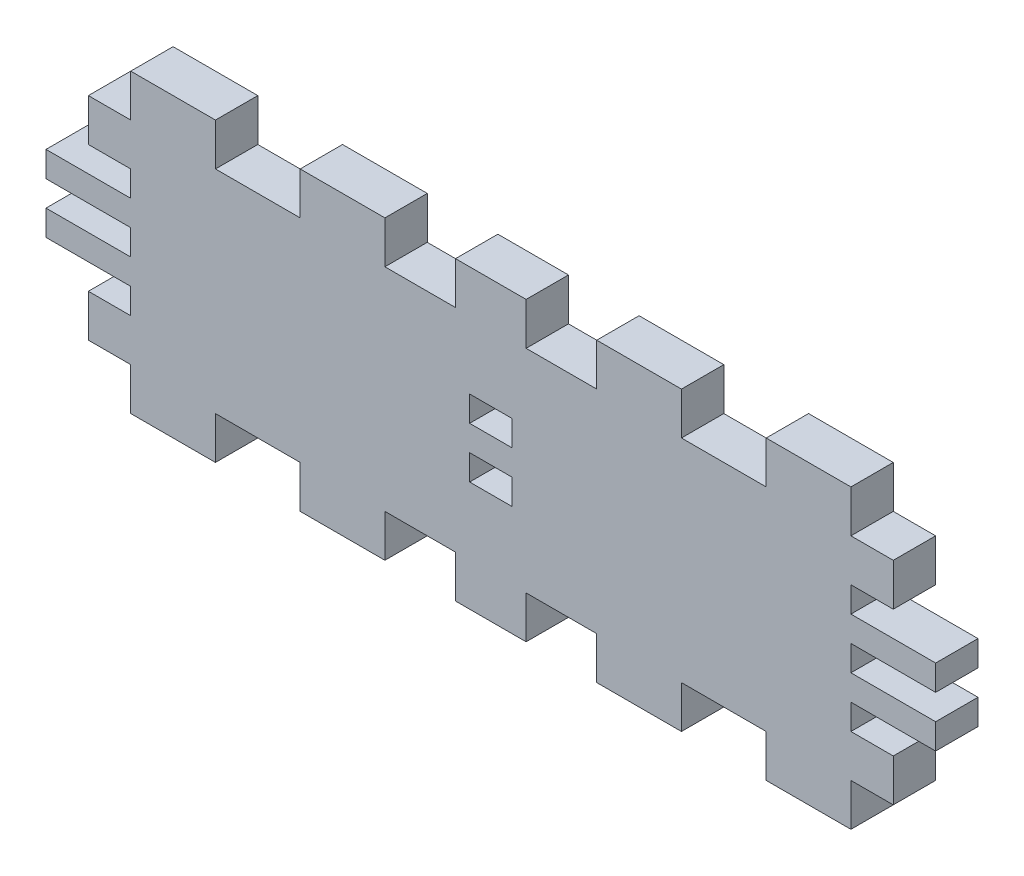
ISO-10303-21;
HEADER;
FILE_DESCRIPTION(('STEP AP214'),'2;1');
FILE_NAME('part.step','',(''),(''),'','','');
FILE_SCHEMA(('AUTOMOTIVE_DESIGN { 1 0 10303 214 1 1 1 1 }'));
ENDSEC;
DATA;
#1=APPLICATION_CONTEXT('core data for automotive mechanical design processes');
#2=APPLICATION_PROTOCOL_DEFINITION('international standard','automotive_design',2000,#1);
#3=PRODUCT_CONTEXT('',#1,'mechanical');
#4=PRODUCT('Part','Part','',(#3));
#5=PRODUCT_RELATED_PRODUCT_CATEGORY('part','',(#4));
#6=PRODUCT_DEFINITION_FORMATION('','',#4);
#7=PRODUCT_DEFINITION_CONTEXT('part definition',#1,'design');
#8=PRODUCT_DEFINITION('design','',#6,#7);
#9=PRODUCT_DEFINITION_SHAPE('','',#8);
#10=(LENGTH_UNIT() NAMED_UNIT(*) SI_UNIT(.MILLI.,.METRE.));
#11=(NAMED_UNIT(*) PLANE_ANGLE_UNIT() SI_UNIT($,.RADIAN.));
#12=(NAMED_UNIT(*) SI_UNIT($,.STERADIAN.) SOLID_ANGLE_UNIT());
#13=UNCERTAINTY_MEASURE_WITH_UNIT(LENGTH_MEASURE(1.E-05),#10,'distance_accuracy_value','');
#14=(GEOMETRIC_REPRESENTATION_CONTEXT(3) GLOBAL_UNCERTAINTY_ASSIGNED_CONTEXT((#13)) GLOBAL_UNIT_ASSIGNED_CONTEXT((#10,
#11,#12)) REPRESENTATION_CONTEXT('',''));
#15=CARTESIAN_POINT('',(0.,0.,0.));
#16=DIRECTION('',(0.,0.,1.));
#17=DIRECTION('',(1.,0.,0.));
#18=AXIS2_PLACEMENT_3D('',#15,#16,#17);
#19=CARTESIAN_POINT('',(-31.5,-10.5,3.));
#20=DIRECTION('',(0.,1.,0.));
#21=DIRECTION('',(0.,0.,1.));
#22=AXIS2_PLACEMENT_3D('',#19,#20,#21);
#23=PLANE('',#22);
#24=DIRECTION('',(1.,0.,0.));
#25=VECTOR('',#24,1.);
#26=CARTESIAN_POINT('',(-31.5,-10.5,0.));
#27=LINE('',#26,#25);
#28=CARTESIAN_POINT('',(7.50000000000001,-10.5,0.));
#29=VERTEX_POINT('',#28);
#30=CARTESIAN_POINT('',(13.5,-10.5,0.));
#31=VERTEX_POINT('',#30);
#32=EDGE_CURVE('E1070',#29,#31,#27,.T.);
#33=ORIENTED_EDGE('',*,*,#32,.T.);
#34=DIRECTION('',(0.,0.,-1.));
#35=VECTOR('',#34,1.);
#36=CARTESIAN_POINT('',(13.5,-10.5,10.));
#37=LINE('',#36,#35);
#38=CARTESIAN_POINT('',(13.5,-10.5,3.));
#39=VERTEX_POINT('',#38);
#40=EDGE_CURVE('E547',#39,#31,#37,.T.);
#41=ORIENTED_EDGE('',*,*,#40,.F.);
#42=DIRECTION('',(1.,0.,0.));
#43=VECTOR('',#42,1.);
#44=CARTESIAN_POINT('',(-31.5,-10.5,3.));
#45=LINE('',#44,#43);
#46=CARTESIAN_POINT('',(7.50000000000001,-10.5,3.));
#47=VERTEX_POINT('',#46);
#48=EDGE_CURVE('E1252',#47,#39,#45,.T.);
#49=ORIENTED_EDGE('',*,*,#48,.F.);
#50=DIRECTION('',(0.,0.,-1.));
#51=VECTOR('',#50,1.);
#52=CARTESIAN_POINT('',(7.50000000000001,-10.5,10.));
#53=LINE('',#52,#51);
#54=EDGE_CURVE('E574',#47,#29,#53,.T.);
#55=ORIENTED_EDGE('',*,*,#54,.T.);
#56=EDGE_LOOP('',(#33,#41,#49,#55));
#57=FACE_BOUND('',#56,.T.);
#58=ADVANCED_FACE('F31',(#57),#23,.F.);
#59=CARTESIAN_POINT('',(-2.5,-10.5,0.));
#60=VERTEX_POINT('',#59);
#61=CARTESIAN_POINT('',(2.5,-10.5,0.));
#62=VERTEX_POINT('',#61);
#63=EDGE_CURVE('E1234',#60,#62,#27,.T.);
#64=ORIENTED_EDGE('',*,*,#63,.T.);
#65=DIRECTION('',(0.,0.,-1.));
#66=VECTOR('',#65,1.);
#67=CARTESIAN_POINT('',(2.5,-10.5,10.));
#68=LINE('',#67,#66);
#69=CARTESIAN_POINT('',(2.5,-10.5,3.));
#70=VERTEX_POINT('',#69);
#71=EDGE_CURVE('E571',#70,#62,#68,.T.);
#72=ORIENTED_EDGE('',*,*,#71,.F.);
#73=CARTESIAN_POINT('',(-2.5,-10.5,3.));
#74=VERTEX_POINT('',#73);
#75=EDGE_CURVE('E1253',#74,#70,#45,.T.);
#76=ORIENTED_EDGE('',*,*,#75,.F.);
#77=DIRECTION('',(0.,0.,-1.));
#78=VECTOR('',#77,1.);
#79=CARTESIAN_POINT('',(-2.5,-10.5,10.));
#80=LINE('',#79,#78);
#81=EDGE_CURVE('E599',#74,#60,#80,.T.);
#82=ORIENTED_EDGE('',*,*,#81,.T.);
#83=EDGE_LOOP('',(#64,#72,#76,#82));
#84=FACE_BOUND('',#83,.T.);
#85=ADVANCED_FACE('F1196',(#84),#23,.F.);
#86=CARTESIAN_POINT('',(-13.5,-10.5,0.));
#87=VERTEX_POINT('',#86);
#88=CARTESIAN_POINT('',(-7.5,-10.5,0.));
#89=VERTEX_POINT('',#88);
#90=EDGE_CURVE('E1232',#87,#89,#27,.T.);
#91=ORIENTED_EDGE('',*,*,#90,.T.);
#92=DIRECTION('',(0.,0.,-1.));
#93=VECTOR('',#92,1.);
#94=CARTESIAN_POINT('',(-7.5,-10.5,10.));
#95=LINE('',#94,#93);
#96=CARTESIAN_POINT('',(-7.5,-10.5,3.));
#97=VERTEX_POINT('',#96);
#98=EDGE_CURVE('E596',#97,#89,#95,.T.);
#99=ORIENTED_EDGE('',*,*,#98,.F.);
#100=CARTESIAN_POINT('',(-13.5,-10.5,3.));
#101=VERTEX_POINT('',#100);
#102=EDGE_CURVE('E40',#101,#97,#45,.T.);
#103=ORIENTED_EDGE('',*,*,#102,.F.);
#104=DIRECTION('',(0.,0.,-1.));
#105=VECTOR('',#104,1.);
#106=CARTESIAN_POINT('',(-13.5,-10.5,10.));
#107=LINE('',#106,#105);
#108=EDGE_CURVE('E625',#101,#87,#107,.T.);
#109=ORIENTED_EDGE('',*,*,#108,.T.);
#110=EDGE_LOOP('',(#91,#99,#103,#109));
#111=FACE_BOUND('',#110,.T.);
#112=ADVANCED_FACE('F1203',(#111),#23,.F.);
#113=CARTESIAN_POINT('',(-25.5,-10.5,0.));
#114=VERTEX_POINT('',#113);
#115=CARTESIAN_POINT('',(-19.5,-10.5,0.));
#116=VERTEX_POINT('',#115);
#117=EDGE_CURVE('E35',#114,#116,#27,.T.);
#118=ORIENTED_EDGE('',*,*,#117,.T.);
#119=DIRECTION('',(0.,0.,-1.));
#120=VECTOR('',#119,1.);
#121=CARTESIAN_POINT('',(-19.5,-10.5,10.));
#122=LINE('',#121,#120);
#123=CARTESIAN_POINT('',(-19.5,-10.5,3.));
#124=VERTEX_POINT('',#123);
#125=EDGE_CURVE('E622',#124,#116,#122,.T.);
#126=ORIENTED_EDGE('',*,*,#125,.F.);
#127=CARTESIAN_POINT('',(-25.5,-10.5,3.));
#128=VERTEX_POINT('',#127);
#129=EDGE_CURVE('E11',#128,#124,#45,.T.);
#130=ORIENTED_EDGE('',*,*,#129,.F.);
#131=DIRECTION('',(0.,0.,-1.));
#132=VECTOR('',#131,1.);
#133=CARTESIAN_POINT('',(-25.5,-10.5,10.));
#134=LINE('',#133,#132);
#135=EDGE_CURVE('E645',#128,#114,#134,.T.);
#136=ORIENTED_EDGE('',*,*,#135,.T.);
#137=EDGE_LOOP('',(#118,#126,#130,#136));
#138=FACE_BOUND('',#137,.T.);
#139=ADVANCED_FACE('F1210',(#138),#23,.F.);
#140=CARTESIAN_POINT('',(-31.5,10.5,3.));
#141=DIRECTION('',(0.,-1.,0.));
#142=DIRECTION('',(0.,0.,-1.));
#143=AXIS2_PLACEMENT_3D('',#140,#141,#142);
#144=PLANE('',#143);
#145=DIRECTION('',(-1.,0.,0.));
#146=VECTOR('',#145,1.);
#147=CARTESIAN_POINT('',(-31.5,10.5,0.));
#148=LINE('',#147,#146);
#149=CARTESIAN_POINT('',(-19.5,10.5,0.));
#150=VERTEX_POINT('',#149);
#151=CARTESIAN_POINT('',(-25.5,10.5,0.));
#152=VERTEX_POINT('',#151);
#153=EDGE_CURVE('E1060',#150,#152,#148,.T.);
#154=ORIENTED_EDGE('',*,*,#153,.T.);
#155=DIRECTION('',(0.,0.,-1.));
#156=VECTOR('',#155,1.);
#157=CARTESIAN_POINT('',(-25.5,10.5,10.));
#158=LINE('',#157,#156);
#159=CARTESIAN_POINT('',(-25.5,10.5,3.));
#160=VERTEX_POINT('',#159);
#161=EDGE_CURVE('E661',#160,#152,#158,.T.);
#162=ORIENTED_EDGE('',*,*,#161,.F.);
#163=DIRECTION('',(-1.,0.,0.));
#164=VECTOR('',#163,1.);
#165=CARTESIAN_POINT('',(-31.5,10.5,3.));
#166=LINE('',#165,#164);
#167=CARTESIAN_POINT('',(-19.5,10.5,3.));
#168=VERTEX_POINT('',#167);
#169=EDGE_CURVE('E1049',#168,#160,#166,.T.);
#170=ORIENTED_EDGE('',*,*,#169,.F.);
#171=DIRECTION('',(0.,0.,-1.));
#172=VECTOR('',#171,1.);
#173=CARTESIAN_POINT('',(-19.5,10.5,10.));
#174=LINE('',#173,#172);
#175=EDGE_CURVE('E679',#168,#150,#174,.T.);
#176=ORIENTED_EDGE('',*,*,#175,.T.);
#177=EDGE_LOOP('',(#154,#162,#170,#176));
#178=FACE_BOUND('',#177,.T.);
#179=ADVANCED_FACE('F1133',(#178),#144,.F.);
#180=CARTESIAN_POINT('',(2.5,10.5,0.));
#181=VERTEX_POINT('',#180);
#182=CARTESIAN_POINT('',(-2.5,10.5,0.));
#183=VERTEX_POINT('',#182);
#184=EDGE_CURVE('E1138',#181,#183,#148,.T.);
#185=ORIENTED_EDGE('',*,*,#184,.T.);
#186=DIRECTION('',(0.,0.,-1.));
#187=VECTOR('',#186,1.);
#188=CARTESIAN_POINT('',(-2.5,10.5,10.));
#189=LINE('',#188,#187);
#190=CARTESIAN_POINT('',(-2.5,10.5,3.));
#191=VERTEX_POINT('',#190);
#192=EDGE_CURVE('E705',#191,#183,#189,.T.);
#193=ORIENTED_EDGE('',*,*,#192,.F.);
#194=CARTESIAN_POINT('',(2.5,10.5,3.));
#195=VERTEX_POINT('',#194);
#196=EDGE_CURVE('E1166',#195,#191,#166,.T.);
#197=ORIENTED_EDGE('',*,*,#196,.F.);
#198=DIRECTION('',(0.,0.,-1.));
#199=VECTOR('',#198,1.);
#200=CARTESIAN_POINT('',(2.5,10.5,10.));
#201=LINE('',#200,#199);
#202=EDGE_CURVE('E734',#195,#181,#201,.T.);
#203=ORIENTED_EDGE('',*,*,#202,.T.);
#204=EDGE_LOOP('',(#185,#193,#197,#203));
#205=FACE_BOUND('',#204,.T.);
#206=ADVANCED_FACE('F1224',(#205),#144,.F.);
#207=CARTESIAN_POINT('',(13.5,10.5,0.));
#208=VERTEX_POINT('',#207);
#209=CARTESIAN_POINT('',(7.50000000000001,10.5,0.));
#210=VERTEX_POINT('',#209);
#211=EDGE_CURVE('E1064',#208,#210,#148,.T.);
#212=ORIENTED_EDGE('',*,*,#211,.T.);
#213=DIRECTION('',(0.,0.,-1.));
#214=VECTOR('',#213,1.);
#215=CARTESIAN_POINT('',(7.50000000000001,10.5,10.));
#216=LINE('',#215,#214);
#217=CARTESIAN_POINT('',(7.50000000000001,10.5,3.));
#218=VERTEX_POINT('',#217);
#219=EDGE_CURVE('E731',#218,#210,#216,.T.);
#220=ORIENTED_EDGE('',*,*,#219,.F.);
#221=CARTESIAN_POINT('',(13.5,10.5,3.));
#222=VERTEX_POINT('',#221);
#223=EDGE_CURVE('E1055',#222,#218,#166,.T.);
#224=ORIENTED_EDGE('',*,*,#223,.F.);
#225=DIRECTION('',(0.,0.,-1.));
#226=VECTOR('',#225,1.);
#227=CARTESIAN_POINT('',(13.5,10.5,10.));
#228=LINE('',#227,#226);
#229=EDGE_CURVE('E760',#222,#208,#228,.T.);
#230=ORIENTED_EDGE('',*,*,#229,.T.);
#231=EDGE_LOOP('',(#212,#220,#224,#230));
#232=FACE_BOUND('',#231,.T.);
#233=ADVANCED_FACE('F1150',(#232),#144,.F.);
#234=CARTESIAN_POINT('',(25.5,10.5,0.));
#235=VERTEX_POINT('',#234);
#236=CARTESIAN_POINT('',(19.5,10.5,0.));
#237=VERTEX_POINT('',#236);
#238=EDGE_CURVE('E1061',#235,#237,#148,.T.);
#239=ORIENTED_EDGE('',*,*,#238,.T.);
#240=DIRECTION('',(0.,0.,-1.));
#241=VECTOR('',#240,1.);
#242=CARTESIAN_POINT('',(19.5,10.5,10.));
#243=LINE('',#242,#241);
#244=CARTESIAN_POINT('',(19.5,10.5,3.));
#245=VERTEX_POINT('',#244);
#246=EDGE_CURVE('E757',#245,#237,#243,.T.);
#247=ORIENTED_EDGE('',*,*,#246,.F.);
#248=CARTESIAN_POINT('',(25.5,10.5,3.));
#249=VERTEX_POINT('',#248);
#250=EDGE_CURVE('E1051',#249,#245,#166,.T.);
#251=ORIENTED_EDGE('',*,*,#250,.F.);
#252=DIRECTION('',(0.,0.,-1.));
#253=VECTOR('',#252,1.);
#254=CARTESIAN_POINT('',(25.5,10.5,10.));
#255=LINE('',#254,#253);
#256=EDGE_CURVE('E780',#249,#235,#255,.T.);
#257=ORIENTED_EDGE('',*,*,#256,.T.);
#258=EDGE_LOOP('',(#239,#247,#251,#257));
#259=FACE_BOUND('',#258,.T.);
#260=ADVANCED_FACE('F1217',(#259),#144,.F.);
#261=CARTESIAN_POINT('',(-31.5,-10.5,3.));
#262=DIRECTION('',(1.,0.,0.));
#263=DIRECTION('',(0.,0.,-1.));
#264=AXIS2_PLACEMENT_3D('',#261,#262,#263);
#265=PLANE('',#264);
#266=DIRECTION('',(0.,-1.,0.));
#267=VECTOR('',#266,1.);
#268=CARTESIAN_POINT('',(-31.5,-10.5,3.));
#269=LINE('',#268,#267);
#270=CARTESIAN_POINT('',(-31.5,2.7,3.));
#271=VERTEX_POINT('',#270);
#272=CARTESIAN_POINT('',(-31.5,0.900000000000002,3.));
#273=VERTEX_POINT('',#272);
#274=EDGE_CURVE('E1056',#271,#273,#269,.T.);
#275=ORIENTED_EDGE('',*,*,#274,.F.);
#276=DIRECTION('',(0.,0.,-1.));
#277=VECTOR('',#276,1.);
#278=CARTESIAN_POINT('',(-31.5,2.7,10.));
#279=LINE('',#278,#277);
#280=CARTESIAN_POINT('',(-31.5,2.7,0.));
#281=VERTEX_POINT('',#280);
#282=EDGE_CURVE('E802',#271,#281,#279,.T.);
#283=ORIENTED_EDGE('',*,*,#282,.T.);
#284=DIRECTION('',(0.,-1.,0.));
#285=VECTOR('',#284,1.);
#286=CARTESIAN_POINT('',(-31.5,-10.5,0.));
#287=LINE('',#286,#285);
#288=CARTESIAN_POINT('',(-31.5,0.900000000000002,0.));
#289=VERTEX_POINT('',#288);
#290=EDGE_CURVE('E1065',#281,#289,#287,.T.);
#291=ORIENTED_EDGE('',*,*,#290,.T.);
#292=DIRECTION('',(0.,0.,-1.));
#293=VECTOR('',#292,1.);
#294=CARTESIAN_POINT('',(-31.5,0.900000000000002,10.));
#295=LINE('',#294,#293);
#296=EDGE_CURVE('E837',#273,#289,#295,.T.);
#297=ORIENTED_EDGE('',*,*,#296,.F.);
#298=EDGE_LOOP('',(#275,#283,#291,#297));
#299=FACE_BOUND('',#298,.T.);
#300=ADVANCED_FACE('F1105',(#299),#265,.F.);
#301=CARTESIAN_POINT('',(-31.5,-0.899999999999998,3.));
#302=VERTEX_POINT('',#301);
#303=CARTESIAN_POINT('',(-31.5,-2.7,3.));
#304=VERTEX_POINT('',#303);
#305=EDGE_CURVE('E1054',#302,#304,#269,.T.);
#306=ORIENTED_EDGE('',*,*,#305,.F.);
#307=DIRECTION('',(0.,0.,-1.));
#308=VECTOR('',#307,1.);
#309=CARTESIAN_POINT('',(-31.5,-0.899999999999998,10.));
#310=LINE('',#309,#308);
#311=CARTESIAN_POINT('',(-31.5,-0.899999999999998,0.));
#312=VERTEX_POINT('',#311);
#313=EDGE_CURVE('E840',#302,#312,#310,.T.);
#314=ORIENTED_EDGE('',*,*,#313,.T.);
#315=CARTESIAN_POINT('',(-31.5,-2.7,0.));
#316=VERTEX_POINT('',#315);
#317=EDGE_CURVE('E1063',#312,#316,#287,.T.);
#318=ORIENTED_EDGE('',*,*,#317,.T.);
#319=DIRECTION('',(0.,0.,-1.));
#320=VECTOR('',#319,1.);
#321=CARTESIAN_POINT('',(-31.5,-2.7,10.));
#322=LINE('',#321,#320);
#323=EDGE_CURVE('E873',#304,#316,#322,.T.);
#324=ORIENTED_EDGE('',*,*,#323,.F.);
#325=EDGE_LOOP('',(#306,#314,#318,#324));
#326=FACE_BOUND('',#325,.T.);
#327=ADVANCED_FACE('F1075',(#326),#265,.F.);
#328=CARTESIAN_POINT('',(31.5,-10.5,3.));
#329=DIRECTION('',(-1.,0.,0.));
#330=DIRECTION('',(0.,0.,1.));
#331=AXIS2_PLACEMENT_3D('',#328,#329,#330);
#332=PLANE('',#331);
#333=DIRECTION('',(0.,1.,0.));
#334=VECTOR('',#333,1.);
#335=CARTESIAN_POINT('',(31.5,-10.5,3.));
#336=LINE('',#335,#334);
#337=CARTESIAN_POINT('',(31.5,-2.7,3.));
#338=VERTEX_POINT('',#337);
#339=CARTESIAN_POINT('',(31.5,-0.899999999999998,3.));
#340=VERTEX_POINT('',#339);
#341=EDGE_CURVE('E1047',#338,#340,#336,.T.);
#342=ORIENTED_EDGE('',*,*,#341,.F.);
#343=DIRECTION('',(0.,0.,-1.));
#344=VECTOR('',#343,1.);
#345=CARTESIAN_POINT('',(31.5,-2.7,10.));
#346=LINE('',#345,#344);
#347=CARTESIAN_POINT('',(31.5,-2.7,0.));
#348=VERTEX_POINT('',#347);
#349=EDGE_CURVE('E897',#338,#348,#346,.T.);
#350=ORIENTED_EDGE('',*,*,#349,.T.);
#351=DIRECTION('',(0.,1.,0.));
#352=VECTOR('',#351,1.);
#353=CARTESIAN_POINT('',(31.5,-10.5,0.));
#354=LINE('',#353,#352);
#355=CARTESIAN_POINT('',(31.5,-0.899999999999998,0.));
#356=VERTEX_POINT('',#355);
#357=EDGE_CURVE('E1058',#348,#356,#354,.T.);
#358=ORIENTED_EDGE('',*,*,#357,.T.);
#359=DIRECTION('',(0.,0.,-1.));
#360=VECTOR('',#359,1.);
#361=CARTESIAN_POINT('',(31.5,-0.899999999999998,10.));
#362=LINE('',#361,#360);
#363=EDGE_CURVE('E931',#340,#356,#362,.T.);
#364=ORIENTED_EDGE('',*,*,#363,.F.);
#365=EDGE_LOOP('',(#342,#350,#358,#364));
#366=FACE_BOUND('',#365,.T.);
#367=ADVANCED_FACE('F33',(#366),#332,.F.);
#368=CARTESIAN_POINT('',(31.5,0.900000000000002,3.));
#369=VERTEX_POINT('',#368);
#370=CARTESIAN_POINT('',(31.5,2.7,3.));
#371=VERTEX_POINT('',#370);
#372=EDGE_CURVE('E1050',#369,#371,#336,.T.);
#373=ORIENTED_EDGE('',*,*,#372,.F.);
#374=DIRECTION('',(0.,0.,-1.));
#375=VECTOR('',#374,1.);
#376=CARTESIAN_POINT('',(31.5,0.900000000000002,10.));
#377=LINE('',#376,#375);
#378=CARTESIAN_POINT('',(31.5,0.900000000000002,0.));
#379=VERTEX_POINT('',#378);
#380=EDGE_CURVE('E934',#369,#379,#377,.T.);
#381=ORIENTED_EDGE('',*,*,#380,.T.);
#382=CARTESIAN_POINT('',(31.5,2.7,0.));
#383=VERTEX_POINT('',#382);
#384=EDGE_CURVE('E1046',#379,#383,#354,.T.);
#385=ORIENTED_EDGE('',*,*,#384,.T.);
#386=DIRECTION('',(0.,0.,-1.));
#387=VECTOR('',#386,1.);
#388=CARTESIAN_POINT('',(31.5,2.7,10.));
#389=LINE('',#388,#387);
#390=EDGE_CURVE('E967',#371,#383,#389,.T.);
#391=ORIENTED_EDGE('',*,*,#390,.F.);
#392=EDGE_LOOP('',(#373,#381,#385,#391));
#393=FACE_BOUND('',#392,.T.);
#394=ADVANCED_FACE('F1216',(#393),#332,.F.);
#395=CARTESIAN_POINT('',(-7.50000000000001,10.5,0.));
#396=VERTEX_POINT('',#395);
#397=CARTESIAN_POINT('',(-13.5,10.5,0.));
#398=VERTEX_POINT('',#397);
#399=EDGE_CURVE('E1136',#396,#398,#148,.T.);
#400=ORIENTED_EDGE('',*,*,#399,.T.);
#401=DIRECTION('',(0.,0.,-1.));
#402=VECTOR('',#401,1.);
#403=CARTESIAN_POINT('',(-13.5,10.5,10.));
#404=LINE('',#403,#402);
#405=CARTESIAN_POINT('',(-13.5,10.5,3.));
#406=VERTEX_POINT('',#405);
#407=EDGE_CURVE('E685',#406,#398,#404,.T.);
#408=ORIENTED_EDGE('',*,*,#407,.F.);
#409=CARTESIAN_POINT('',(-7.50000000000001,10.5,3.));
#410=VERTEX_POINT('',#409);
#411=EDGE_CURVE('E1167',#410,#406,#166,.T.);
#412=ORIENTED_EDGE('',*,*,#411,.F.);
#413=DIRECTION('',(0.,0.,-1.));
#414=VECTOR('',#413,1.);
#415=CARTESIAN_POINT('',(-7.50000000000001,10.5,10.));
#416=LINE('',#415,#414);
#417=EDGE_CURVE('E708',#410,#396,#416,.T.);
#418=ORIENTED_EDGE('',*,*,#417,.T.);
#419=EDGE_LOOP('',(#400,#408,#412,#418));
#420=FACE_BOUND('',#419,.T.);
#421=ADVANCED_FACE('F1170',(#420),#144,.F.);
#422=CARTESIAN_POINT('',(19.5,-10.5,0.));
#423=VERTEX_POINT('',#422);
#424=CARTESIAN_POINT('',(25.5,-10.5,0.));
#425=VERTEX_POINT('',#424);
#426=EDGE_CURVE('E1066',#423,#425,#27,.T.);
#427=ORIENTED_EDGE('',*,*,#426,.T.);
#428=DIRECTION('',(0.,0.,-1.));
#429=VECTOR('',#428,1.);
#430=CARTESIAN_POINT('',(25.5,-10.5,10.));
#431=LINE('',#430,#429);
#432=CARTESIAN_POINT('',(25.5,-10.5,3.));
#433=VERTEX_POINT('',#432);
#434=EDGE_CURVE('E518',#433,#425,#431,.T.);
#435=ORIENTED_EDGE('',*,*,#434,.F.);
#436=CARTESIAN_POINT('',(19.5,-10.5,3.));
#437=VERTEX_POINT('',#436);
#438=EDGE_CURVE('E42',#437,#433,#45,.T.);
#439=ORIENTED_EDGE('',*,*,#438,.F.);
#440=DIRECTION('',(0.,0.,-1.));
#441=VECTOR('',#440,1.);
#442=CARTESIAN_POINT('',(19.5,-10.5,10.));
#443=LINE('',#442,#441);
#444=EDGE_CURVE('E550',#437,#423,#443,.T.);
#445=ORIENTED_EDGE('',*,*,#444,.T.);
#446=EDGE_LOOP('',(#427,#435,#439,#445));
#447=FACE_BOUND('',#446,.T.);
#448=ADVANCED_FACE('F1199',(#447),#23,.F.);
#449=CARTESIAN_POINT('',(31.5,10.5,3.));
#450=DIRECTION('',(0.,0.,-1.));
#451=DIRECTION('',(-1.,0.,0.));
#452=AXIS2_PLACEMENT_3D('',#449,#450,#451);
#453=PLANE('',#452);
#454=ORIENTED_EDGE('',*,*,#438,.T.);
#455=DIRECTION('',(0.,1.,0.));
#456=VECTOR('',#455,1.);
#457=CARTESIAN_POINT('',(25.5,10.5,3.));
#458=LINE('',#457,#456);
#459=CARTESIAN_POINT('',(25.5,-7.5,3.));
#460=VERTEX_POINT('',#459);
#461=EDGE_CURVE('E538',#433,#460,#458,.T.);
#462=ORIENTED_EDGE('',*,*,#461,.T.);
#463=DIRECTION('',(1.,0.,0.));
#464=VECTOR('',#463,1.);
#465=CARTESIAN_POINT('',(31.5,-7.5,3.));
#466=LINE('',#465,#464);
#467=CARTESIAN_POINT('',(28.5,-7.5,3.));
#468=VERTEX_POINT('',#467);
#469=EDGE_CURVE('E515',#460,#468,#466,.T.);
#470=ORIENTED_EDGE('',*,*,#469,.T.);
#471=DIRECTION('',(0.,1.,0.));
#472=VECTOR('',#471,1.);
#473=CARTESIAN_POINT('',(28.5,10.5,3.));
#474=LINE('',#473,#472);
#475=CARTESIAN_POINT('',(28.5,-4.5,3.));
#476=VERTEX_POINT('',#475);
#477=EDGE_CURVE('E900',#468,#476,#474,.T.);
#478=ORIENTED_EDGE('',*,*,#477,.T.);
#479=DIRECTION('',(-1.,0.,0.));
#480=VECTOR('',#479,1.);
#481=CARTESIAN_POINT('',(31.5,-4.5,3.));
#482=LINE('',#481,#480);
#483=CARTESIAN_POINT('',(25.5,-4.5,3.));
#484=VERTEX_POINT('',#483);
#485=EDGE_CURVE('E911',#476,#484,#482,.T.);
#486=ORIENTED_EDGE('',*,*,#485,.T.);
#487=DIRECTION('',(0.,1.,0.));
#488=VECTOR('',#487,1.);
#489=CARTESIAN_POINT('',(25.5,10.5,3.));
#490=LINE('',#489,#488);
#491=CARTESIAN_POINT('',(25.5,-2.7,3.));
#492=VERTEX_POINT('',#491);
#493=EDGE_CURVE('E914',#484,#492,#490,.T.);
#494=ORIENTED_EDGE('',*,*,#493,.T.);
#495=DIRECTION('',(1.,0.,0.));
#496=VECTOR('',#495,1.);
#497=CARTESIAN_POINT('',(31.5,-2.7,3.));
#498=LINE('',#497,#496);
#499=EDGE_CURVE('E917',#492,#338,#498,.T.);
#500=ORIENTED_EDGE('',*,*,#499,.T.);
#501=ORIENTED_EDGE('',*,*,#341,.T.);
#502=DIRECTION('',(-1.,0.,0.));
#503=VECTOR('',#502,1.);
#504=CARTESIAN_POINT('',(31.5,-0.899999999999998,3.));
#505=LINE('',#504,#503);
#506=CARTESIAN_POINT('',(25.5,-0.899999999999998,3.));
#507=VERTEX_POINT('',#506);
#508=EDGE_CURVE('E941',#340,#507,#505,.T.);
#509=ORIENTED_EDGE('',*,*,#508,.T.);
#510=DIRECTION('',(0.,1.,0.));
#511=VECTOR('',#510,1.);
#512=CARTESIAN_POINT('',(25.5,10.5,3.));
#513=LINE('',#512,#511);
#514=CARTESIAN_POINT('',(25.5,0.900000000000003,3.));
#515=VERTEX_POINT('',#514);
#516=EDGE_CURVE('E944',#507,#515,#513,.T.);
#517=ORIENTED_EDGE('',*,*,#516,.T.);
#518=DIRECTION('',(1.,0.,0.));
#519=VECTOR('',#518,1.);
#520=CARTESIAN_POINT('',(31.5,0.900000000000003,3.));
#521=LINE('',#520,#519);
#522=EDGE_CURVE('E930',#515,#369,#521,.T.);
#523=ORIENTED_EDGE('',*,*,#522,.T.);
#524=ORIENTED_EDGE('',*,*,#372,.T.);
#525=DIRECTION('',(-1.,0.,0.));
#526=VECTOR('',#525,1.);
#527=CARTESIAN_POINT('',(31.5,2.7,3.));
#528=LINE('',#527,#526);
#529=CARTESIAN_POINT('',(25.5,2.7,3.));
#530=VERTEX_POINT('',#529);
#531=EDGE_CURVE('E962',#371,#530,#528,.T.);
#532=ORIENTED_EDGE('',*,*,#531,.T.);
#533=DIRECTION('',(0.,1.,0.));
#534=VECTOR('',#533,1.);
#535=CARTESIAN_POINT('',(25.5,10.5,3.));
#536=LINE('',#535,#534);
#537=CARTESIAN_POINT('',(25.5,4.5,3.));
#538=VERTEX_POINT('',#537);
#539=EDGE_CURVE('E973',#530,#538,#536,.T.);
#540=ORIENTED_EDGE('',*,*,#539,.T.);
#541=DIRECTION('',(1.,0.,0.));
#542=VECTOR('',#541,1.);
#543=CARTESIAN_POINT('',(31.5,4.5,3.));
#544=LINE('',#543,#542);
#545=CARTESIAN_POINT('',(28.5,4.5,3.));
#546=VERTEX_POINT('',#545);
#547=EDGE_CURVE('E976',#538,#546,#544,.T.);
#548=ORIENTED_EDGE('',*,*,#547,.T.);
#549=DIRECTION('',(0.,1.,0.));
#550=VECTOR('',#549,1.);
#551=CARTESIAN_POINT('',(28.5,10.5,3.));
#552=LINE('',#551,#550);
#553=CARTESIAN_POINT('',(28.5,7.49999999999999,3.));
#554=VERTEX_POINT('',#553);
#555=EDGE_CURVE('E979',#546,#554,#552,.T.);
#556=ORIENTED_EDGE('',*,*,#555,.T.);
#557=DIRECTION('',(-1.,0.,0.));
#558=VECTOR('',#557,1.);
#559=CARTESIAN_POINT('',(31.5,7.5,3.));
#560=LINE('',#559,#558);
#561=CARTESIAN_POINT('',(25.5,7.5,3.));
#562=VERTEX_POINT('',#561);
#563=EDGE_CURVE('E783',#554,#562,#560,.T.);
#564=ORIENTED_EDGE('',*,*,#563,.T.);
#565=DIRECTION('',(0.,1.,0.));
#566=VECTOR('',#565,1.);
#567=CARTESIAN_POINT('',(25.5,10.5,3.));
#568=LINE('',#567,#566);
#569=EDGE_CURVE('E788',#562,#249,#568,.T.);
#570=ORIENTED_EDGE('',*,*,#569,.T.);
#571=ORIENTED_EDGE('',*,*,#250,.T.);
#572=DIRECTION('',(0.,-1.,0.));
#573=VECTOR('',#572,1.);
#574=CARTESIAN_POINT('',(19.5,10.5,3.));
#575=LINE('',#574,#573);
#576=CARTESIAN_POINT('',(19.5,7.5,3.));
#577=VERTEX_POINT('',#576);
#578=EDGE_CURVE('E772',#245,#577,#575,.T.);
#579=ORIENTED_EDGE('',*,*,#578,.T.);
#580=DIRECTION('',(-1.,0.,0.));
#581=VECTOR('',#580,1.);
#582=CARTESIAN_POINT('',(31.5,7.5,3.));
#583=LINE('',#582,#581);
#584=CARTESIAN_POINT('',(13.5,7.5,3.));
#585=VERTEX_POINT('',#584);
#586=EDGE_CURVE('E759',#577,#585,#583,.T.);
#587=ORIENTED_EDGE('',*,*,#586,.T.);
#588=DIRECTION('',(0.,1.,0.));
#589=VECTOR('',#588,1.);
#590=CARTESIAN_POINT('',(13.5,10.5,3.));
#591=LINE('',#590,#589);
#592=EDGE_CURVE('E769',#585,#222,#591,.T.);
#593=ORIENTED_EDGE('',*,*,#592,.T.);
#594=ORIENTED_EDGE('',*,*,#223,.T.);
#595=DIRECTION('',(0.,-1.,0.));
#596=VECTOR('',#595,1.);
#597=CARTESIAN_POINT('',(7.50000000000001,10.5,3.));
#598=LINE('',#597,#596);
#599=CARTESIAN_POINT('',(7.50000000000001,7.5,3.));
#600=VERTEX_POINT('',#599);
#601=EDGE_CURVE('E746',#218,#600,#598,.T.);
#602=ORIENTED_EDGE('',*,*,#601,.T.);
#603=DIRECTION('',(-1.,0.,0.));
#604=VECTOR('',#603,1.);
#605=CARTESIAN_POINT('',(31.5,7.5,3.));
#606=LINE('',#605,#604);
#607=CARTESIAN_POINT('',(2.5,7.5,3.));
#608=VERTEX_POINT('',#607);
#609=EDGE_CURVE('E733',#600,#608,#606,.T.);
#610=ORIENTED_EDGE('',*,*,#609,.T.);
#611=DIRECTION('',(0.,1.,0.));
#612=VECTOR('',#611,1.);
#613=CARTESIAN_POINT('',(2.5,10.5,3.));
#614=LINE('',#613,#612);
#615=EDGE_CURVE('E743',#608,#195,#614,.T.);
#616=ORIENTED_EDGE('',*,*,#615,.T.);
#617=ORIENTED_EDGE('',*,*,#196,.T.);
#618=DIRECTION('',(0.,-1.,0.));
#619=VECTOR('',#618,1.);
#620=CARTESIAN_POINT('',(-2.5,10.5,3.));
#621=LINE('',#620,#619);
#622=CARTESIAN_POINT('',(-2.5,7.5,3.));
#623=VERTEX_POINT('',#622);
#624=EDGE_CURVE('E720',#191,#623,#621,.T.);
#625=ORIENTED_EDGE('',*,*,#624,.T.);
#626=DIRECTION('',(-1.,0.,0.));
#627=VECTOR('',#626,1.);
#628=CARTESIAN_POINT('',(31.5,7.5,3.));
#629=LINE('',#628,#627);
#630=CARTESIAN_POINT('',(-7.50000000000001,7.5,3.));
#631=VERTEX_POINT('',#630);
#632=EDGE_CURVE('E707',#623,#631,#629,.T.);
#633=ORIENTED_EDGE('',*,*,#632,.T.);
#634=DIRECTION('',(0.,1.,0.));
#635=VECTOR('',#634,1.);
#636=CARTESIAN_POINT('',(-7.50000000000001,10.5,3.));
#637=LINE('',#636,#635);
#638=EDGE_CURVE('E717',#631,#410,#637,.T.);
#639=ORIENTED_EDGE('',*,*,#638,.T.);
#640=ORIENTED_EDGE('',*,*,#411,.T.);
#641=DIRECTION('',(0.,-1.,0.));
#642=VECTOR('',#641,1.);
#643=CARTESIAN_POINT('',(-13.5,10.5,3.));
#644=LINE('',#643,#642);
#645=CARTESIAN_POINT('',(-13.5,7.5,3.));
#646=VERTEX_POINT('',#645);
#647=EDGE_CURVE('E682',#406,#646,#644,.T.);
#648=ORIENTED_EDGE('',*,*,#647,.T.);
#649=DIRECTION('',(-1.,0.,0.));
#650=VECTOR('',#649,1.);
#651=CARTESIAN_POINT('',(31.5,7.5,3.));
#652=LINE('',#651,#650);
#653=CARTESIAN_POINT('',(-19.5,7.5,3.));
#654=VERTEX_POINT('',#653);
#655=EDGE_CURVE('E691',#646,#654,#652,.T.);
#656=ORIENTED_EDGE('',*,*,#655,.T.);
#657=DIRECTION('',(0.,1.,0.));
#658=VECTOR('',#657,1.);
#659=CARTESIAN_POINT('',(-19.5,10.5,3.));
#660=LINE('',#659,#658);
#661=EDGE_CURVE('E694',#654,#168,#660,.T.);
#662=ORIENTED_EDGE('',*,*,#661,.T.);
#663=ORIENTED_EDGE('',*,*,#169,.T.);
#664=DIRECTION('',(0.,-1.,0.));
#665=VECTOR('',#664,1.);
#666=CARTESIAN_POINT('',(-25.5,10.5,3.));
#667=LINE('',#666,#665);
#668=CARTESIAN_POINT('',(-25.5,7.5,3.));
#669=VERTEX_POINT('',#668);
#670=EDGE_CURVE('E668',#160,#669,#667,.T.);
#671=ORIENTED_EDGE('',*,*,#670,.T.);
#672=DIRECTION('',(-1.,0.,0.));
#673=VECTOR('',#672,1.);
#674=CARTESIAN_POINT('',(31.5,7.5,3.));
#675=LINE('',#674,#673);
#676=CARTESIAN_POINT('',(-28.5,7.5,3.));
#677=VERTEX_POINT('',#676);
#678=EDGE_CURVE('E664',#669,#677,#675,.T.);
#679=ORIENTED_EDGE('',*,*,#678,.T.);
#680=DIRECTION('',(0.,-1.,0.));
#681=VECTOR('',#680,1.);
#682=CARTESIAN_POINT('',(-28.5,10.5,3.));
#683=LINE('',#682,#681);
#684=CARTESIAN_POINT('',(-28.5,4.5,3.));
#685=VERTEX_POINT('',#684);
#686=EDGE_CURVE('E805',#677,#685,#683,.T.);
#687=ORIENTED_EDGE('',*,*,#686,.T.);
#688=DIRECTION('',(1.,0.,0.));
#689=VECTOR('',#688,1.);
#690=CARTESIAN_POINT('',(31.5,4.49999999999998,3.));
#691=LINE('',#690,#689);
#692=CARTESIAN_POINT('',(-25.5,4.5,3.));
#693=VERTEX_POINT('',#692);
#694=EDGE_CURVE('E817',#685,#693,#691,.T.);
#695=ORIENTED_EDGE('',*,*,#694,.T.);
#696=DIRECTION('',(0.,-1.,0.));
#697=VECTOR('',#696,1.);
#698=CARTESIAN_POINT('',(-25.5,10.5,3.));
#699=LINE('',#698,#697);
#700=CARTESIAN_POINT('',(-25.5,2.7,3.));
#701=VERTEX_POINT('',#700);
#702=EDGE_CURVE('E820',#693,#701,#699,.T.);
#703=ORIENTED_EDGE('',*,*,#702,.T.);
#704=DIRECTION('',(-1.,0.,0.));
#705=VECTOR('',#704,1.);
#706=CARTESIAN_POINT('',(31.5,2.69999999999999,3.));
#707=LINE('',#706,#705);
#708=EDGE_CURVE('E823',#701,#271,#707,.T.);
#709=ORIENTED_EDGE('',*,*,#708,.T.);
#710=ORIENTED_EDGE('',*,*,#274,.T.);
#711=DIRECTION('',(1.,0.,0.));
#712=VECTOR('',#711,1.);
#713=CARTESIAN_POINT('',(31.5,0.900000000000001,3.));
#714=LINE('',#713,#712);
#715=CARTESIAN_POINT('',(-25.5,0.900000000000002,3.));
#716=VERTEX_POINT('',#715);
#717=EDGE_CURVE('E847',#273,#716,#714,.T.);
#718=ORIENTED_EDGE('',*,*,#717,.T.);
#719=DIRECTION('',(0.,-1.,0.));
#720=VECTOR('',#719,1.);
#721=CARTESIAN_POINT('',(-25.5,10.5,3.));
#722=LINE('',#721,#720);
#723=CARTESIAN_POINT('',(-25.5,-0.899999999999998,3.));
#724=VERTEX_POINT('',#723);
#725=EDGE_CURVE('E850',#716,#724,#722,.T.);
#726=ORIENTED_EDGE('',*,*,#725,.T.);
#727=DIRECTION('',(-1.,0.,0.));
#728=VECTOR('',#727,1.);
#729=CARTESIAN_POINT('',(31.5,-0.899999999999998,3.));
#730=LINE('',#729,#728);
#731=EDGE_CURVE('E836',#724,#302,#730,.T.);
#732=ORIENTED_EDGE('',*,*,#731,.T.);
#733=ORIENTED_EDGE('',*,*,#305,.T.);
#734=DIRECTION('',(1.,0.,0.));
#735=VECTOR('',#734,1.);
#736=CARTESIAN_POINT('',(31.5,-2.7,3.));
#737=LINE('',#736,#735);
#738=CARTESIAN_POINT('',(-25.5,-2.7,3.));
#739=VERTEX_POINT('',#738);
#740=EDGE_CURVE('E868',#304,#739,#737,.T.);
#741=ORIENTED_EDGE('',*,*,#740,.T.);
#742=DIRECTION('',(0.,-1.,0.));
#743=VECTOR('',#742,1.);
#744=CARTESIAN_POINT('',(-25.5,10.5,3.));
#745=LINE('',#744,#743);
#746=CARTESIAN_POINT('',(-25.5,-4.5,3.));
#747=VERTEX_POINT('',#746);
#748=EDGE_CURVE('E879',#739,#747,#745,.T.);
#749=ORIENTED_EDGE('',*,*,#748,.T.);
#750=DIRECTION('',(-1.,0.,0.));
#751=VECTOR('',#750,1.);
#752=CARTESIAN_POINT('',(31.5,-4.5,3.));
#753=LINE('',#752,#751);
#754=CARTESIAN_POINT('',(-28.5,-4.5,3.));
#755=VERTEX_POINT('',#754);
#756=EDGE_CURVE('E882',#747,#755,#753,.T.);
#757=ORIENTED_EDGE('',*,*,#756,.T.);
#758=DIRECTION('',(0.,-1.,0.));
#759=VECTOR('',#758,1.);
#760=CARTESIAN_POINT('',(-28.5,10.5,3.));
#761=LINE('',#760,#759);
#762=CARTESIAN_POINT('',(-28.5,-7.5,3.));
#763=VERTEX_POINT('',#762);
#764=EDGE_CURVE('E885',#755,#763,#761,.T.);
#765=ORIENTED_EDGE('',*,*,#764,.T.);
#766=DIRECTION('',(1.,0.,0.));
#767=VECTOR('',#766,1.);
#768=CARTESIAN_POINT('',(31.5,-7.5,3.));
#769=LINE('',#768,#767);
#770=CARTESIAN_POINT('',(-25.5,-7.5,3.));
#771=VERTEX_POINT('',#770);
#772=EDGE_CURVE('E648',#763,#771,#769,.T.);
#773=ORIENTED_EDGE('',*,*,#772,.T.);
#774=DIRECTION('',(0.,-1.,0.));
#775=VECTOR('',#774,1.);
#776=CARTESIAN_POINT('',(-25.5,10.5,3.));
#777=LINE('',#776,#775);
#778=EDGE_CURVE('E653',#771,#128,#777,.T.);
#779=ORIENTED_EDGE('',*,*,#778,.T.);
#780=ORIENTED_EDGE('',*,*,#129,.T.);
#781=DIRECTION('',(0.,1.,0.));
#782=VECTOR('',#781,1.);
#783=CARTESIAN_POINT('',(-19.5,10.5,3.));
#784=LINE('',#783,#782);
#785=CARTESIAN_POINT('',(-19.5,-7.5,3.));
#786=VERTEX_POINT('',#785);
#787=EDGE_CURVE('E637',#124,#786,#784,.T.);
#788=ORIENTED_EDGE('',*,*,#787,.T.);
#789=DIRECTION('',(1.,0.,0.));
#790=VECTOR('',#789,1.);
#791=CARTESIAN_POINT('',(31.5,-7.50000000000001,3.));
#792=LINE('',#791,#790);
#793=CARTESIAN_POINT('',(-13.5,-7.5,3.));
#794=VERTEX_POINT('',#793);
#795=EDGE_CURVE('E624',#786,#794,#792,.T.);
#796=ORIENTED_EDGE('',*,*,#795,.T.);
#797=DIRECTION('',(0.,-1.,0.));
#798=VECTOR('',#797,1.);
#799=CARTESIAN_POINT('',(-13.5,10.5,3.));
#800=LINE('',#799,#798);
#801=EDGE_CURVE('E634',#794,#101,#800,.T.);
#802=ORIENTED_EDGE('',*,*,#801,.T.);
#803=ORIENTED_EDGE('',*,*,#102,.T.);
#804=DIRECTION('',(0.,1.,0.));
#805=VECTOR('',#804,1.);
#806=CARTESIAN_POINT('',(-7.50000000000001,10.5,3.));
#807=LINE('',#806,#805);
#808=CARTESIAN_POINT('',(-7.5,-7.5,3.));
#809=VERTEX_POINT('',#808);
#810=EDGE_CURVE('E611',#97,#809,#807,.T.);
#811=ORIENTED_EDGE('',*,*,#810,.T.);
#812=DIRECTION('',(1.,0.,0.));
#813=VECTOR('',#812,1.);
#814=CARTESIAN_POINT('',(31.5,-7.5,3.));
#815=LINE('',#814,#813);
#816=CARTESIAN_POINT('',(-2.5,-7.5,3.));
#817=VERTEX_POINT('',#816);
#818=EDGE_CURVE('E598',#809,#817,#815,.T.);
#819=ORIENTED_EDGE('',*,*,#818,.T.);
#820=DIRECTION('',(0.,-1.,0.));
#821=VECTOR('',#820,1.);
#822=CARTESIAN_POINT('',(-2.5,10.5,3.));
#823=LINE('',#822,#821);
#824=EDGE_CURVE('E608',#817,#74,#823,.T.);
#825=ORIENTED_EDGE('',*,*,#824,.T.);
#826=ORIENTED_EDGE('',*,*,#75,.T.);
#827=DIRECTION('',(0.,1.,0.));
#828=VECTOR('',#827,1.);
#829=CARTESIAN_POINT('',(2.50000000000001,10.5,3.));
#830=LINE('',#829,#828);
#831=CARTESIAN_POINT('',(2.5,-7.5,3.));
#832=VERTEX_POINT('',#831);
#833=EDGE_CURVE('E585',#70,#832,#830,.T.);
#834=ORIENTED_EDGE('',*,*,#833,.T.);
#835=DIRECTION('',(1.,0.,0.));
#836=VECTOR('',#835,1.);
#837=CARTESIAN_POINT('',(31.5,-7.5,3.));
#838=LINE('',#837,#836);
#839=CARTESIAN_POINT('',(7.50000000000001,-7.5,3.));
#840=VERTEX_POINT('',#839);
#841=EDGE_CURVE('E573',#832,#840,#838,.T.);
#842=ORIENTED_EDGE('',*,*,#841,.T.);
#843=DIRECTION('',(0.,-1.,0.));
#844=VECTOR('',#843,1.);
#845=CARTESIAN_POINT('',(7.50000000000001,10.5,3.));
#846=LINE('',#845,#844);
#847=EDGE_CURVE('E582',#840,#47,#846,.T.);
#848=ORIENTED_EDGE('',*,*,#847,.T.);
#849=ORIENTED_EDGE('',*,*,#48,.T.);
#850=DIRECTION('',(0.,1.,0.));
#851=VECTOR('',#850,1.);
#852=CARTESIAN_POINT('',(13.5,10.5,3.));
#853=LINE('',#852,#851);
#854=CARTESIAN_POINT('',(13.5,-7.5,3.));
#855=VERTEX_POINT('',#854);
#856=EDGE_CURVE('E561',#39,#855,#853,.T.);
#857=ORIENTED_EDGE('',*,*,#856,.T.);
#858=DIRECTION('',(1.,0.,0.));
#859=VECTOR('',#858,1.);
#860=CARTESIAN_POINT('',(31.5,-7.5,3.));
#861=LINE('',#860,#859);
#862=CARTESIAN_POINT('',(19.5,-7.5,3.));
#863=VERTEX_POINT('',#862);
#864=EDGE_CURVE('E549',#855,#863,#861,.T.);
#865=ORIENTED_EDGE('',*,*,#864,.T.);
#866=DIRECTION('',(0.,-1.,0.));
#867=VECTOR('',#866,1.);
#868=CARTESIAN_POINT('',(19.5,10.5,3.));
#869=LINE('',#868,#867);
#870=EDGE_CURVE('E558',#863,#437,#869,.T.);
#871=ORIENTED_EDGE('',*,*,#870,.T.);
#872=EDGE_LOOP('',(#454,#462,#470,#478,#486,#494,#500,#501,#509,#517,#523,#524,#532,#540,#548,
#556,#564,#570,#571,#579,#587,#593,#594,#602,#610,#616,#617,#625,#633,#639,#640,#648,#656,#662,
#663,#671,#679,#687,#695,#703,#709,#710,#718,#726,#732,#733,#741,#749,#757,#765,#773,#779,#780,
#788,#796,#802,#803,#811,#819,#825,#826,#834,#842,#848,#849,#857,#865,#871));
#873=FACE_BOUND('',#872,.T.);
#874=DIRECTION('',(1.,0.,0.));
#875=VECTOR('',#874,1.);
#876=CARTESIAN_POINT('',(31.5,-0.9,3.));
#877=LINE('',#876,#875);
#878=CARTESIAN_POINT('',(-1.5,-0.9,3.));
#879=VERTEX_POINT('',#878);
#880=CARTESIAN_POINT('',(1.5,-0.9,3.));
#881=VERTEX_POINT('',#880);
#882=EDGE_CURVE('E1008',#879,#881,#877,.T.);
#883=ORIENTED_EDGE('',*,*,#882,.T.);
#884=DIRECTION('',(0.,-1.,0.));
#885=VECTOR('',#884,1.);
#886=CARTESIAN_POINT('',(1.5,10.5,3.));
#887=LINE('',#886,#885);
#888=CARTESIAN_POINT('',(1.5,-2.7,3.));
#889=VERTEX_POINT('',#888);
#890=EDGE_CURVE('E1011',#881,#889,#887,.T.);
#891=ORIENTED_EDGE('',*,*,#890,.T.);
#892=DIRECTION('',(-1.,0.,0.));
#893=VECTOR('',#892,1.);
#894=CARTESIAN_POINT('',(31.5,-2.7,3.));
#895=LINE('',#894,#893);
#896=CARTESIAN_POINT('',(-1.5,-2.7,3.));
#897=VERTEX_POINT('',#896);
#898=EDGE_CURVE('E996',#889,#897,#895,.T.);
#899=ORIENTED_EDGE('',*,*,#898,.T.);
#900=DIRECTION('',(0.,1.,0.));
#901=VECTOR('',#900,1.);
#902=CARTESIAN_POINT('',(-1.5,10.5,3.));
#903=LINE('',#902,#901);
#904=EDGE_CURVE('E1005',#897,#879,#903,.T.);
#905=ORIENTED_EDGE('',*,*,#904,.T.);
#906=EDGE_LOOP('',(#883,#891,#899,#905));
#907=FACE_BOUND('',#906,.T.);
#908=DIRECTION('',(1.,0.,0.));
#909=VECTOR('',#908,1.);
#910=CARTESIAN_POINT('',(31.5,2.7,3.));
#911=LINE('',#910,#909);
#912=CARTESIAN_POINT('',(-1.5,2.7,3.));
#913=VERTEX_POINT('',#912);
#914=CARTESIAN_POINT('',(1.5,2.7,3.));
#915=VERTEX_POINT('',#914);
#916=EDGE_CURVE('E1040',#913,#915,#911,.T.);
#917=ORIENTED_EDGE('',*,*,#916,.T.);
#918=DIRECTION('',(0.,-1.,0.));
#919=VECTOR('',#918,1.);
#920=CARTESIAN_POINT('',(1.5,10.5,3.));
#921=LINE('',#920,#919);
#922=CARTESIAN_POINT('',(1.5,0.9,3.));
#923=VERTEX_POINT('',#922);
#924=EDGE_CURVE('E1043',#915,#923,#921,.T.);
#925=ORIENTED_EDGE('',*,*,#924,.T.);
#926=DIRECTION('',(-1.,0.,0.));
#927=VECTOR('',#926,1.);
#928=CARTESIAN_POINT('',(31.5,0.9,3.));
#929=LINE('',#928,#927);
#930=CARTESIAN_POINT('',(-1.5,0.9,3.));
#931=VERTEX_POINT('',#930);
#932=EDGE_CURVE('E1028',#923,#931,#929,.T.);
#933=ORIENTED_EDGE('',*,*,#932,.T.);
#934=DIRECTION('',(0.,1.,0.));
#935=VECTOR('',#934,1.);
#936=CARTESIAN_POINT('',(-1.5,10.5,3.));
#937=LINE('',#936,#935);
#938=EDGE_CURVE('E1037',#931,#913,#937,.T.);
#939=ORIENTED_EDGE('',*,*,#938,.T.);
#940=EDGE_LOOP('',(#917,#925,#933,#939));
#941=FACE_BOUND('',#940,.T.);
#942=ADVANCED_FACE('F1090',(#873,#907,#941),#453,.F.);
#943=CARTESIAN_POINT('',(31.5,10.5,0.));
#944=DIRECTION('',(0.,0.,-1.));
#945=DIRECTION('',(-1.,0.,0.));
#946=AXIS2_PLACEMENT_3D('',#943,#944,#945);
#947=PLANE('',#946);
#948=DIRECTION('',(0.,1.,0.));
#949=VECTOR('',#948,1.);
#950=CARTESIAN_POINT('',(25.5,-7.5,0.));
#951=LINE('',#950,#949);
#952=CARTESIAN_POINT('',(25.5,-7.5,0.));
#953=VERTEX_POINT('',#952);
#954=EDGE_CURVE('E521',#425,#953,#951,.T.);
#955=ORIENTED_EDGE('',*,*,#954,.F.);
#956=ORIENTED_EDGE('',*,*,#426,.F.);
#957=DIRECTION('',(0.,-1.,0.));
#958=VECTOR('',#957,1.);
#959=CARTESIAN_POINT('',(19.5,-7.5,0.));
#960=LINE('',#959,#958);
#961=CARTESIAN_POINT('',(19.5,-7.5,0.));
#962=VERTEX_POINT('',#961);
#963=EDGE_CURVE('E544',#962,#423,#960,.T.);
#964=ORIENTED_EDGE('',*,*,#963,.F.);
#965=DIRECTION('',(1.,0.,0.));
#966=VECTOR('',#965,1.);
#967=CARTESIAN_POINT('',(13.5,-7.5,0.));
#968=LINE('',#967,#966);
#969=CARTESIAN_POINT('',(13.5,-7.5,0.));
#970=VERTEX_POINT('',#969);
#971=EDGE_CURVE('E541',#970,#962,#968,.T.);
#972=ORIENTED_EDGE('',*,*,#971,.F.);
#973=DIRECTION('',(0.,1.,0.));
#974=VECTOR('',#973,1.);
#975=CARTESIAN_POINT('',(13.5,-7.5,0.));
#976=LINE('',#975,#974);
#977=EDGE_CURVE('E49',#31,#970,#976,.T.);
#978=ORIENTED_EDGE('',*,*,#977,.F.);
#979=ORIENTED_EDGE('',*,*,#32,.F.);
#980=DIRECTION('',(0.,-1.,0.));
#981=VECTOR('',#980,1.);
#982=CARTESIAN_POINT('',(7.50000000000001,-7.5,0.));
#983=LINE('',#982,#981);
#984=CARTESIAN_POINT('',(7.50000000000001,-7.5,0.));
#985=VERTEX_POINT('',#984);
#986=EDGE_CURVE('E568',#985,#29,#983,.T.);
#987=ORIENTED_EDGE('',*,*,#986,.F.);
#988=DIRECTION('',(1.,0.,0.));
#989=VECTOR('',#988,1.);
#990=CARTESIAN_POINT('',(2.5,-7.5,0.));
#991=LINE('',#990,#989);
#992=CARTESIAN_POINT('',(2.5,-7.5,0.));
#993=VERTEX_POINT('',#992);
#994=EDGE_CURVE('E565',#993,#985,#991,.T.);
#995=ORIENTED_EDGE('',*,*,#994,.F.);
#996=DIRECTION('',(0.,1.,0.));
#997=VECTOR('',#996,1.);
#998=CARTESIAN_POINT('',(2.5,-7.5,0.));
#999=LINE('',#998,#997);
#1000=EDGE_CURVE('E57',#62,#993,#999,.T.);
#1001=ORIENTED_EDGE('',*,*,#1000,.F.);
#1002=ORIENTED_EDGE('',*,*,#63,.F.);
#1003=DIRECTION('',(0.,-1.,0.));
#1004=VECTOR('',#1003,1.);
#1005=CARTESIAN_POINT('',(-2.5,-7.5,0.));
#1006=LINE('',#1005,#1004);
#1007=CARTESIAN_POINT('',(-2.5,-7.5,0.));
#1008=VERTEX_POINT('',#1007);
#1009=EDGE_CURVE('E593',#1008,#60,#1006,.T.);
#1010=ORIENTED_EDGE('',*,*,#1009,.F.);
#1011=DIRECTION('',(1.,0.,0.));
#1012=VECTOR('',#1011,1.);
#1013=CARTESIAN_POINT('',(-7.5,-7.5,0.));
#1014=LINE('',#1013,#1012);
#1015=CARTESIAN_POINT('',(-7.5,-7.5,0.));
#1016=VERTEX_POINT('',#1015);
#1017=EDGE_CURVE('E590',#1016,#1008,#1014,.T.);
#1018=ORIENTED_EDGE('',*,*,#1017,.F.);
#1019=DIRECTION('',(0.,1.,0.));
#1020=VECTOR('',#1019,1.);
#1021=CARTESIAN_POINT('',(-7.5,-7.5,0.));
#1022=LINE('',#1021,#1020);
#1023=EDGE_CURVE('E588',#89,#1016,#1022,.T.);
#1024=ORIENTED_EDGE('',*,*,#1023,.F.);
#1025=ORIENTED_EDGE('',*,*,#90,.F.);
#1026=DIRECTION('',(0.,-1.,0.));
#1027=VECTOR('',#1026,1.);
#1028=CARTESIAN_POINT('',(-13.5,-7.5,0.));
#1029=LINE('',#1028,#1027);
#1030=CARTESIAN_POINT('',(-13.5,-7.5,0.));
#1031=VERTEX_POINT('',#1030);
#1032=EDGE_CURVE('E619',#1031,#87,#1029,.T.);
#1033=ORIENTED_EDGE('',*,*,#1032,.F.);
#1034=DIRECTION('',(1.,0.,0.));
#1035=VECTOR('',#1034,1.);
#1036=CARTESIAN_POINT('',(-19.5,-7.5,0.));
#1037=LINE('',#1036,#1035);
#1038=CARTESIAN_POINT('',(-19.5,-7.5,0.));
#1039=VERTEX_POINT('',#1038);
#1040=EDGE_CURVE('E616',#1039,#1031,#1037,.T.);
#1041=ORIENTED_EDGE('',*,*,#1040,.F.);
#1042=DIRECTION('',(0.,1.,0.));
#1043=VECTOR('',#1042,1.);
#1044=CARTESIAN_POINT('',(-19.5,-7.5,0.));
#1045=LINE('',#1044,#1043);
#1046=EDGE_CURVE('E614',#116,#1039,#1045,.T.);
#1047=ORIENTED_EDGE('',*,*,#1046,.F.);
#1048=ORIENTED_EDGE('',*,*,#117,.F.);
#1049=DIRECTION('',(0.,-1.,0.));
#1050=VECTOR('',#1049,1.);
#1051=CARTESIAN_POINT('',(-25.5,-7.5,0.));
#1052=LINE('',#1051,#1050);
#1053=CARTESIAN_POINT('',(-25.5,-7.5,0.));
#1054=VERTEX_POINT('',#1053);
#1055=EDGE_CURVE('E640',#1054,#114,#1052,.T.);
#1056=ORIENTED_EDGE('',*,*,#1055,.F.);
#1057=DIRECTION('',(1.,0.,0.));
#1058=VECTOR('',#1057,1.);
#1059=CARTESIAN_POINT('',(-25.5,-7.5,0.));
#1060=LINE('',#1059,#1058);
#1061=CARTESIAN_POINT('',(-28.5,-7.5,0.));
#1062=VERTEX_POINT('',#1061);
#1063=EDGE_CURVE('E642',#1062,#1054,#1060,.T.);
#1064=ORIENTED_EDGE('',*,*,#1063,.F.);
#1065=DIRECTION('',(0.,-1.,0.));
#1066=VECTOR('',#1065,1.);
#1067=CARTESIAN_POINT('',(-28.5,-7.5,0.));
#1068=LINE('',#1067,#1066);
#1069=CARTESIAN_POINT('',(-28.5,-4.5,0.));
#1070=VERTEX_POINT('',#1069);
#1071=EDGE_CURVE('E853',#1070,#1062,#1068,.T.);
#1072=ORIENTED_EDGE('',*,*,#1071,.F.);
#1073=DIRECTION('',(-1.,0.,0.));
#1074=VECTOR('',#1073,1.);
#1075=CARTESIAN_POINT('',(-28.5,-4.5,0.));
#1076=LINE('',#1075,#1074);
#1077=CARTESIAN_POINT('',(-25.5,-4.5,0.));
#1078=VERTEX_POINT('',#1077);
#1079=EDGE_CURVE('E862',#1078,#1070,#1076,.T.);
#1080=ORIENTED_EDGE('',*,*,#1079,.F.);
#1081=DIRECTION('',(0.,-1.,0.));
#1082=VECTOR('',#1081,1.);
#1083=CARTESIAN_POINT('',(-25.5,-4.5,0.));
#1084=LINE('',#1083,#1082);
#1085=CARTESIAN_POINT('',(-25.5,-2.7,0.));
#1086=VERTEX_POINT('',#1085);
#1087=EDGE_CURVE('E859',#1086,#1078,#1084,.T.);
#1088=ORIENTED_EDGE('',*,*,#1087,.F.);
#1089=DIRECTION('',(1.,0.,0.));
#1090=VECTOR('',#1089,1.);
#1091=CARTESIAN_POINT('',(-28.5,-2.7,0.));
#1092=LINE('',#1091,#1090);
#1093=EDGE_CURVE('E856',#316,#1086,#1092,.T.);
#1094=ORIENTED_EDGE('',*,*,#1093,.F.);
#1095=ORIENTED_EDGE('',*,*,#317,.F.);
#1096=DIRECTION('',(-1.,0.,0.));
#1097=VECTOR('',#1096,1.);
#1098=CARTESIAN_POINT('',(-25.5,-0.899999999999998,0.));
#1099=LINE('',#1098,#1097);
#1100=CARTESIAN_POINT('',(-25.5,-0.899999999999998,0.));
#1101=VERTEX_POINT('',#1100);
#1102=EDGE_CURVE('E828',#1101,#312,#1099,.T.);
#1103=ORIENTED_EDGE('',*,*,#1102,.F.);
#1104=DIRECTION('',(0.,-1.,0.));
#1105=VECTOR('',#1104,1.);
#1106=CARTESIAN_POINT('',(-25.5,-0.899999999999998,0.));
#1107=LINE('',#1106,#1105);
#1108=CARTESIAN_POINT('',(-25.5,0.900000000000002,0.));
#1109=VERTEX_POINT('',#1108);
#1110=EDGE_CURVE('E826',#1109,#1101,#1107,.T.);
#1111=ORIENTED_EDGE('',*,*,#1110,.F.);
#1112=DIRECTION('',(1.,0.,0.));
#1113=VECTOR('',#1112,1.);
#1114=CARTESIAN_POINT('',(-25.5,0.900000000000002,0.));
#1115=LINE('',#1114,#1113);
#1116=EDGE_CURVE('E830',#289,#1109,#1115,.T.);
#1117=ORIENTED_EDGE('',*,*,#1116,.F.);
#1118=ORIENTED_EDGE('',*,*,#290,.F.);
#1119=DIRECTION('',(-1.,0.,0.));
#1120=VECTOR('',#1119,1.);
#1121=CARTESIAN_POINT('',(-28.5,2.7,0.));
#1122=LINE('',#1121,#1120);
#1123=CARTESIAN_POINT('',(-25.5,2.7,0.));
#1124=VERTEX_POINT('',#1123);
#1125=EDGE_CURVE('E800',#1124,#281,#1122,.T.);
#1126=ORIENTED_EDGE('',*,*,#1125,.F.);
#1127=DIRECTION('',(0.,-1.,0.));
#1128=VECTOR('',#1127,1.);
#1129=CARTESIAN_POINT('',(-25.5,2.7,0.));
#1130=LINE('',#1129,#1128);
#1131=CARTESIAN_POINT('',(-25.5,4.5,0.));
#1132=VERTEX_POINT('',#1131);
#1133=EDGE_CURVE('E797',#1132,#1124,#1130,.T.);
#1134=ORIENTED_EDGE('',*,*,#1133,.F.);
#1135=DIRECTION('',(1.,0.,0.));
#1136=VECTOR('',#1135,1.);
#1137=CARTESIAN_POINT('',(-28.5,4.5,0.));
#1138=LINE('',#1137,#1136);
#1139=CARTESIAN_POINT('',(-28.5,4.5,0.));
#1140=VERTEX_POINT('',#1139);
#1141=EDGE_CURVE('E794',#1140,#1132,#1138,.T.);
#1142=ORIENTED_EDGE('',*,*,#1141,.F.);
#1143=DIRECTION('',(0.,-1.,0.));
#1144=VECTOR('',#1143,1.);
#1145=CARTESIAN_POINT('',(-28.5,4.5,0.));
#1146=LINE('',#1145,#1144);
#1147=CARTESIAN_POINT('',(-28.5,7.5,0.));
#1148=VERTEX_POINT('',#1147);
#1149=EDGE_CURVE('E791',#1148,#1140,#1146,.T.);
#1150=ORIENTED_EDGE('',*,*,#1149,.F.);
#1151=DIRECTION('',(-1.,0.,0.));
#1152=VECTOR('',#1151,1.);
#1153=CARTESIAN_POINT('',(-31.5,7.5,0.));
#1154=LINE('',#1153,#1152);
#1155=CARTESIAN_POINT('',(-25.5,7.5,0.));
#1156=VERTEX_POINT('',#1155);
#1157=EDGE_CURVE('E656',#1156,#1148,#1154,.T.);
#1158=ORIENTED_EDGE('',*,*,#1157,.F.);
#1159=DIRECTION('',(0.,-1.,0.));
#1160=VECTOR('',#1159,1.);
#1161=CARTESIAN_POINT('',(-25.5,7.5,0.));
#1162=LINE('',#1161,#1160);
#1163=EDGE_CURVE('E658',#152,#1156,#1162,.T.);
#1164=ORIENTED_EDGE('',*,*,#1163,.F.);
#1165=ORIENTED_EDGE('',*,*,#153,.F.);
#1166=DIRECTION('',(0.,1.,0.));
#1167=VECTOR('',#1166,1.);
#1168=CARTESIAN_POINT('',(-19.5,10.5,0.));
#1169=LINE('',#1168,#1167);
#1170=CARTESIAN_POINT('',(-19.5,7.5,0.));
#1171=VERTEX_POINT('',#1170);
#1172=EDGE_CURVE('E671',#1171,#150,#1169,.T.);
#1173=ORIENTED_EDGE('',*,*,#1172,.F.);
#1174=DIRECTION('',(-1.,0.,0.));
#1175=VECTOR('',#1174,1.);
#1176=CARTESIAN_POINT('',(-19.5,7.5,0.));
#1177=LINE('',#1176,#1175);
#1178=CARTESIAN_POINT('',(-13.5,7.5,0.));
#1179=VERTEX_POINT('',#1178);
#1180=EDGE_CURVE('E676',#1179,#1171,#1177,.T.);
#1181=ORIENTED_EDGE('',*,*,#1180,.F.);
#1182=DIRECTION('',(0.,-1.,0.));
#1183=VECTOR('',#1182,1.);
#1184=CARTESIAN_POINT('',(-13.5,10.5,0.));
#1185=LINE('',#1184,#1183);
#1186=EDGE_CURVE('E673',#398,#1179,#1185,.T.);
#1187=ORIENTED_EDGE('',*,*,#1186,.F.);
#1188=ORIENTED_EDGE('',*,*,#399,.F.);
#1189=DIRECTION('',(0.,1.,0.));
#1190=VECTOR('',#1189,1.);
#1191=CARTESIAN_POINT('',(-7.50000000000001,7.5,0.));
#1192=LINE('',#1191,#1190);
#1193=CARTESIAN_POINT('',(-7.50000000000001,7.5,0.));
#1194=VERTEX_POINT('',#1193);
#1195=EDGE_CURVE('E702',#1194,#396,#1192,.T.);
#1196=ORIENTED_EDGE('',*,*,#1195,.F.);
#1197=DIRECTION('',(-1.,0.,0.));
#1198=VECTOR('',#1197,1.);
#1199=CARTESIAN_POINT('',(-2.5,7.5,0.));
#1200=LINE('',#1199,#1198);
#1201=CARTESIAN_POINT('',(-2.5,7.5,0.));
#1202=VERTEX_POINT('',#1201);
#1203=EDGE_CURVE('E699',#1202,#1194,#1200,.T.);
#1204=ORIENTED_EDGE('',*,*,#1203,.F.);
#1205=DIRECTION('',(0.,-1.,0.));
#1206=VECTOR('',#1205,1.);
#1207=CARTESIAN_POINT('',(-2.5,7.5,0.));
#1208=LINE('',#1207,#1206);
#1209=EDGE_CURVE('E697',#183,#1202,#1208,.T.);
#1210=ORIENTED_EDGE('',*,*,#1209,.F.);
#1211=ORIENTED_EDGE('',*,*,#184,.F.);
#1212=DIRECTION('',(0.,1.,0.));
#1213=VECTOR('',#1212,1.);
#1214=CARTESIAN_POINT('',(2.5,7.5,0.));
#1215=LINE('',#1214,#1213);
#1216=CARTESIAN_POINT('',(2.5,7.5,0.));
#1217=VERTEX_POINT('',#1216);
#1218=EDGE_CURVE('E728',#1217,#181,#1215,.T.);
#1219=ORIENTED_EDGE('',*,*,#1218,.F.);
#1220=DIRECTION('',(-1.,0.,0.));
#1221=VECTOR('',#1220,1.);
#1222=CARTESIAN_POINT('',(7.50000000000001,7.5,0.));
#1223=LINE('',#1222,#1221);
#1224=CARTESIAN_POINT('',(7.50000000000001,7.5,0.));
#1225=VERTEX_POINT('',#1224);
#1226=EDGE_CURVE('E725',#1225,#1217,#1223,.T.);
#1227=ORIENTED_EDGE('',*,*,#1226,.F.);
#1228=DIRECTION('',(0.,-1.,0.));
#1229=VECTOR('',#1228,1.);
#1230=CARTESIAN_POINT('',(7.50000000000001,7.5,0.));
#1231=LINE('',#1230,#1229);
#1232=EDGE_CURVE('E723',#210,#1225,#1231,.T.);
#1233=ORIENTED_EDGE('',*,*,#1232,.F.);
#1234=ORIENTED_EDGE('',*,*,#211,.F.);
#1235=DIRECTION('',(0.,1.,0.));
#1236=VECTOR('',#1235,1.);
#1237=CARTESIAN_POINT('',(13.5,7.5,0.));
#1238=LINE('',#1237,#1236);
#1239=CARTESIAN_POINT('',(13.5,7.5,0.));
#1240=VERTEX_POINT('',#1239);
#1241=EDGE_CURVE('E754',#1240,#208,#1238,.T.);
#1242=ORIENTED_EDGE('',*,*,#1241,.F.);
#1243=DIRECTION('',(-1.,0.,0.));
#1244=VECTOR('',#1243,1.);
#1245=CARTESIAN_POINT('',(19.5,7.5,0.));
#1246=LINE('',#1245,#1244);
#1247=CARTESIAN_POINT('',(19.5,7.5,0.));
#1248=VERTEX_POINT('',#1247);
#1249=EDGE_CURVE('E751',#1248,#1240,#1246,.T.);
#1250=ORIENTED_EDGE('',*,*,#1249,.F.);
#1251=DIRECTION('',(0.,-1.,0.));
#1252=VECTOR('',#1251,1.);
#1253=CARTESIAN_POINT('',(19.5,7.5,0.));
#1254=LINE('',#1253,#1252);
#1255=EDGE_CURVE('E749',#237,#1248,#1254,.T.);
#1256=ORIENTED_EDGE('',*,*,#1255,.F.);
#1257=ORIENTED_EDGE('',*,*,#238,.F.);
#1258=DIRECTION('',(0.,1.,0.));
#1259=VECTOR('',#1258,1.);
#1260=CARTESIAN_POINT('',(25.5,7.5,0.));
#1261=LINE('',#1260,#1259);
#1262=CARTESIAN_POINT('',(25.5,7.5,0.));
#1263=VERTEX_POINT('',#1262);
#1264=EDGE_CURVE('E775',#1263,#235,#1261,.T.);
#1265=ORIENTED_EDGE('',*,*,#1264,.F.);
#1266=DIRECTION('',(-1.,0.,0.));
#1267=VECTOR('',#1266,1.);
#1268=CARTESIAN_POINT('',(25.5,7.5,0.));
#1269=LINE('',#1268,#1267);
#1270=CARTESIAN_POINT('',(28.5,7.5,0.));
#1271=VERTEX_POINT('',#1270);
#1272=EDGE_CURVE('E777',#1271,#1263,#1269,.T.);
#1273=ORIENTED_EDGE('',*,*,#1272,.F.);
#1274=DIRECTION('',(0.,1.,0.));
#1275=VECTOR('',#1274,1.);
#1276=CARTESIAN_POINT('',(28.5,7.49999999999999,0.));
#1277=LINE('',#1276,#1275);
#1278=CARTESIAN_POINT('',(28.5,4.5,0.));
#1279=VERTEX_POINT('',#1278);
#1280=EDGE_CURVE('E947',#1279,#1271,#1277,.T.);
#1281=ORIENTED_EDGE('',*,*,#1280,.F.);
#1282=DIRECTION('',(1.,0.,0.));
#1283=VECTOR('',#1282,1.);
#1284=CARTESIAN_POINT('',(28.5,4.5,0.));
#1285=LINE('',#1284,#1283);
#1286=CARTESIAN_POINT('',(25.5,4.5,0.));
#1287=VERTEX_POINT('',#1286);
#1288=EDGE_CURVE('E956',#1287,#1279,#1285,.T.);
#1289=ORIENTED_EDGE('',*,*,#1288,.F.);
#1290=DIRECTION('',(0.,1.,0.));
#1291=VECTOR('',#1290,1.);
#1292=CARTESIAN_POINT('',(25.5,4.5,0.));
#1293=LINE('',#1292,#1291);
#1294=CARTESIAN_POINT('',(25.5,2.7,0.));
#1295=VERTEX_POINT('',#1294);
#1296=EDGE_CURVE('E953',#1295,#1287,#1293,.T.);
#1297=ORIENTED_EDGE('',*,*,#1296,.F.);
#1298=DIRECTION('',(-1.,0.,0.));
#1299=VECTOR('',#1298,1.);
#1300=CARTESIAN_POINT('',(28.5,2.7,0.));
#1301=LINE('',#1300,#1299);
#1302=EDGE_CURVE('E950',#383,#1295,#1301,.T.);
#1303=ORIENTED_EDGE('',*,*,#1302,.F.);
#1304=ORIENTED_EDGE('',*,*,#384,.F.);
#1305=DIRECTION('',(1.,0.,0.));
#1306=VECTOR('',#1305,1.);
#1307=CARTESIAN_POINT('',(25.5,0.900000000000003,0.));
#1308=LINE('',#1307,#1306);
#1309=CARTESIAN_POINT('',(25.5,0.900000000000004,0.));
#1310=VERTEX_POINT('',#1309);
#1311=EDGE_CURVE('E922',#1310,#379,#1308,.T.);
#1312=ORIENTED_EDGE('',*,*,#1311,.F.);
#1313=DIRECTION('',(0.,1.,0.));
#1314=VECTOR('',#1313,1.);
#1315=CARTESIAN_POINT('',(25.5,0.900000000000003,0.));
#1316=LINE('',#1315,#1314);
#1317=CARTESIAN_POINT('',(25.5,-0.899999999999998,0.));
#1318=VERTEX_POINT('',#1317);
#1319=EDGE_CURVE('E920',#1318,#1310,#1316,.T.);
#1320=ORIENTED_EDGE('',*,*,#1319,.F.);
#1321=DIRECTION('',(-1.,0.,0.));
#1322=VECTOR('',#1321,1.);
#1323=CARTESIAN_POINT('',(25.5,-0.899999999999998,0.));
#1324=LINE('',#1323,#1322);
#1325=EDGE_CURVE('E924',#356,#1318,#1324,.T.);
#1326=ORIENTED_EDGE('',*,*,#1325,.F.);
#1327=ORIENTED_EDGE('',*,*,#357,.F.);
#1328=DIRECTION('',(1.,0.,0.));
#1329=VECTOR('',#1328,1.);
#1330=CARTESIAN_POINT('',(28.5,-2.7,0.));
#1331=LINE('',#1330,#1329);
#1332=CARTESIAN_POINT('',(25.5,-2.7,0.));
#1333=VERTEX_POINT('',#1332);
#1334=EDGE_CURVE('E895',#1333,#348,#1331,.T.);
#1335=ORIENTED_EDGE('',*,*,#1334,.F.);
#1336=DIRECTION('',(0.,1.,0.));
#1337=VECTOR('',#1336,1.);
#1338=CARTESIAN_POINT('',(25.5,-2.7,0.));
#1339=LINE('',#1338,#1337);
#1340=CARTESIAN_POINT('',(25.5,-4.5,0.));
#1341=VERTEX_POINT('',#1340);
#1342=EDGE_CURVE('E892',#1341,#1333,#1339,.T.);
#1343=ORIENTED_EDGE('',*,*,#1342,.F.);
#1344=DIRECTION('',(-1.,0.,0.));
#1345=VECTOR('',#1344,1.);
#1346=CARTESIAN_POINT('',(28.5,-4.5,0.));
#1347=LINE('',#1346,#1345);
#1348=CARTESIAN_POINT('',(28.5,-4.5,0.));
#1349=VERTEX_POINT('',#1348);
#1350=EDGE_CURVE('E889',#1349,#1341,#1347,.T.);
#1351=ORIENTED_EDGE('',*,*,#1350,.F.);
#1352=DIRECTION('',(0.,1.,0.));
#1353=VECTOR('',#1352,1.);
#1354=CARTESIAN_POINT('',(28.5,-7.5,0.));
#1355=LINE('',#1354,#1353);
#1356=CARTESIAN_POINT('',(28.5,-7.5,0.));
#1357=VERTEX_POINT('',#1356);
#1358=EDGE_CURVE('E533',#1357,#1349,#1355,.T.);
#1359=ORIENTED_EDGE('',*,*,#1358,.F.);
#1360=DIRECTION('',(1.,0.,0.));
#1361=VECTOR('',#1360,1.);
#1362=CARTESIAN_POINT('',(25.5,-7.5,0.));
#1363=LINE('',#1362,#1361);
#1364=EDGE_CURVE('E512',#953,#1357,#1363,.T.);
#1365=ORIENTED_EDGE('',*,*,#1364,.F.);
#1366=EDGE_LOOP('',(#955,#956,#964,#972,#978,#979,#987,#995,#1001,#1002,#1010,#1018,#1024,#1025,
#1033,#1041,#1047,#1048,#1056,#1064,#1072,#1080,#1088,#1094,#1095,#1103,#1111,#1117,#1118,#1126,
#1134,#1142,#1150,#1158,#1164,#1165,#1173,#1181,#1187,#1188,#1196,#1204,#1210,#1211,#1219,#1227,
#1233,#1234,#1242,#1250,#1256,#1257,#1265,#1273,#1281,#1289,#1297,#1303,#1304,#1312,#1320,#1326,
#1327,#1335,#1343,#1351,#1359,#1365));
#1367=FACE_BOUND('',#1366,.T.);
#1368=DIRECTION('',(0.,-1.,0.));
#1369=VECTOR('',#1368,1.);
#1370=CARTESIAN_POINT('',(1.5,-0.9,0.));
#1371=LINE('',#1370,#1369);
#1372=CARTESIAN_POINT('',(1.5,-0.9,0.));
#1373=VERTEX_POINT('',#1372);
#1374=CARTESIAN_POINT('',(1.5,-2.7,0.));
#1375=VERTEX_POINT('',#1374);
#1376=EDGE_CURVE('E982',#1373,#1375,#1371,.T.);
#1377=ORIENTED_EDGE('',*,*,#1376,.F.);
#1378=DIRECTION('',(1.,0.,0.));
#1379=VECTOR('',#1378,1.);
#1380=CARTESIAN_POINT('',(1.5,-0.9,0.));
#1381=LINE('',#1380,#1379);
#1382=CARTESIAN_POINT('',(-1.5,-0.9,0.));
#1383=VERTEX_POINT('',#1382);
#1384=EDGE_CURVE('E990',#1383,#1373,#1381,.T.);
#1385=ORIENTED_EDGE('',*,*,#1384,.F.);
#1386=DIRECTION('',(0.,1.,0.));
#1387=VECTOR('',#1386,1.);
#1388=CARTESIAN_POINT('',(-1.5,-0.9,0.));
#1389=LINE('',#1388,#1387);
#1390=CARTESIAN_POINT('',(-1.5,-2.7,0.));
#1391=VERTEX_POINT('',#1390);
#1392=EDGE_CURVE('E987',#1391,#1383,#1389,.T.);
#1393=ORIENTED_EDGE('',*,*,#1392,.F.);
#1394=DIRECTION('',(-1.,0.,0.));
#1395=VECTOR('',#1394,1.);
#1396=CARTESIAN_POINT('',(1.5,-2.7,0.));
#1397=LINE('',#1396,#1395);
#1398=EDGE_CURVE('E984',#1375,#1391,#1397,.T.);
#1399=ORIENTED_EDGE('',*,*,#1398,.F.);
#1400=EDGE_LOOP('',(#1377,#1385,#1393,#1399));
#1401=FACE_BOUND('',#1400,.T.);
#1402=DIRECTION('',(0.,-1.,0.));
#1403=VECTOR('',#1402,1.);
#1404=CARTESIAN_POINT('',(1.5,2.7,0.));
#1405=LINE('',#1404,#1403);
#1406=CARTESIAN_POINT('',(1.5,2.7,0.));
#1407=VERTEX_POINT('',#1406);
#1408=CARTESIAN_POINT('',(1.5,0.9,0.));
#1409=VERTEX_POINT('',#1408);
#1410=EDGE_CURVE('E1014',#1407,#1409,#1405,.T.);
#1411=ORIENTED_EDGE('',*,*,#1410,.F.);
#1412=DIRECTION('',(1.,0.,0.));
#1413=VECTOR('',#1412,1.);
#1414=CARTESIAN_POINT('',(1.5,2.7,0.));
#1415=LINE('',#1414,#1413);
#1416=CARTESIAN_POINT('',(-1.5,2.7,0.));
#1417=VERTEX_POINT('',#1416);
#1418=EDGE_CURVE('E1022',#1417,#1407,#1415,.T.);
#1419=ORIENTED_EDGE('',*,*,#1418,.F.);
#1420=DIRECTION('',(0.,1.,0.));
#1421=VECTOR('',#1420,1.);
#1422=CARTESIAN_POINT('',(-1.5,2.7,0.));
#1423=LINE('',#1422,#1421);
#1424=CARTESIAN_POINT('',(-1.5,0.9,0.));
#1425=VERTEX_POINT('',#1424);
#1426=EDGE_CURVE('E1019',#1425,#1417,#1423,.T.);
#1427=ORIENTED_EDGE('',*,*,#1426,.F.);
#1428=DIRECTION('',(-1.,0.,0.));
#1429=VECTOR('',#1428,1.);
#1430=CARTESIAN_POINT('',(1.5,0.9,0.));
#1431=LINE('',#1430,#1429);
#1432=EDGE_CURVE('E1016',#1409,#1425,#1431,.T.);
#1433=ORIENTED_EDGE('',*,*,#1432,.F.);
#1434=EDGE_LOOP('',(#1411,#1419,#1427,#1433));
#1435=FACE_BOUND('',#1434,.T.);
#1436=ADVANCED_FACE('F529',(#1367,#1401,#1435),#947,.T.);
#1437=CARTESIAN_POINT('',(1.5,2.7,10.));
#1438=DIRECTION('',(1.,0.,0.));
#1439=DIRECTION('',(0.,0.,-1.));
#1440=AXIS2_PLACEMENT_3D('',#1437,#1438,#1439);
#1441=PLANE('',#1440);
#1442=DIRECTION('',(0.,0.,-1.));
#1443=VECTOR('',#1442,1.);
#1444=CARTESIAN_POINT('',(1.5,2.7,10.));
#1445=LINE('',#1444,#1443);
#1446=EDGE_CURVE('E1026',#915,#1407,#1445,.T.);
#1447=ORIENTED_EDGE('',*,*,#1446,.T.);
#1448=ORIENTED_EDGE('',*,*,#1410,.T.);
#1449=DIRECTION('',(0.,0.,-1.));
#1450=VECTOR('',#1449,1.);
#1451=CARTESIAN_POINT('',(1.5,0.9,10.));
#1452=LINE('',#1451,#1450);
#1453=EDGE_CURVE('E1025',#923,#1409,#1452,.T.);
#1454=ORIENTED_EDGE('',*,*,#1453,.F.);
#1455=ORIENTED_EDGE('',*,*,#924,.F.);
#1456=EDGE_LOOP('',(#1447,#1448,#1454,#1455));
#1457=FACE_BOUND('',#1456,.T.);
#1458=ADVANCED_FACE('F1853',(#1457),#1441,.F.);
#1459=CARTESIAN_POINT('',(1.5,2.7,10.));
#1460=DIRECTION('',(0.,1.,0.));
#1461=DIRECTION('',(0.,0.,1.));
#1462=AXIS2_PLACEMENT_3D('',#1459,#1460,#1461);
#1463=PLANE('',#1462);
#1464=DIRECTION('',(0.,0.,-1.));
#1465=VECTOR('',#1464,1.);
#1466=CARTESIAN_POINT('',(-1.5,2.7,10.));
#1467=LINE('',#1466,#1465);
#1468=EDGE_CURVE('E1029',#913,#1417,#1467,.T.);
#1469=ORIENTED_EDGE('',*,*,#1468,.T.);
#1470=ORIENTED_EDGE('',*,*,#1418,.T.);
#1471=ORIENTED_EDGE('',*,*,#1446,.F.);
#1472=ORIENTED_EDGE('',*,*,#916,.F.);
#1473=EDGE_LOOP('',(#1469,#1470,#1471,#1472));
#1474=FACE_BOUND('',#1473,.T.);
#1475=ADVANCED_FACE('F1843',(#1474),#1463,.F.);
#1476=CARTESIAN_POINT('',(-1.5,2.7,10.));
#1477=DIRECTION('',(-1.,0.,0.));
#1478=DIRECTION('',(0.,0.,1.));
#1479=AXIS2_PLACEMENT_3D('',#1476,#1477,#1478);
#1480=PLANE('',#1479);
#1481=DIRECTION('',(0.,0.,-1.));
#1482=VECTOR('',#1481,1.);
#1483=CARTESIAN_POINT('',(-1.5,0.9,10.));
#1484=LINE('',#1483,#1482);
#1485=EDGE_CURVE('E1031',#931,#1425,#1484,.T.);
#1486=ORIENTED_EDGE('',*,*,#1485,.T.);
#1487=ORIENTED_EDGE('',*,*,#1426,.T.);
#1488=ORIENTED_EDGE('',*,*,#1468,.F.);
#1489=ORIENTED_EDGE('',*,*,#938,.F.);
#1490=EDGE_LOOP('',(#1486,#1487,#1488,#1489));
#1491=FACE_BOUND('',#1490,.T.);
#1492=ADVANCED_FACE('F1833',(#1491),#1480,.F.);
#1493=CARTESIAN_POINT('',(1.5,0.9,10.));
#1494=DIRECTION('',(0.,-1.,0.));
#1495=DIRECTION('',(0.,0.,-1.));
#1496=AXIS2_PLACEMENT_3D('',#1493,#1494,#1495);
#1497=PLANE('',#1496);
#1498=ORIENTED_EDGE('',*,*,#1453,.T.);
#1499=ORIENTED_EDGE('',*,*,#1432,.T.);
#1500=ORIENTED_EDGE('',*,*,#1485,.F.);
#1501=ORIENTED_EDGE('',*,*,#932,.F.);
#1502=EDGE_LOOP('',(#1498,#1499,#1500,#1501));
#1503=FACE_BOUND('',#1502,.T.);
#1504=ADVANCED_FACE('F1823',(#1503),#1497,.F.);
#1505=CARTESIAN_POINT('',(1.5,-0.9,10.));
#1506=DIRECTION('',(1.,0.,0.));
#1507=DIRECTION('',(0.,0.,-1.));
#1508=AXIS2_PLACEMENT_3D('',#1505,#1506,#1507);
#1509=PLANE('',#1508);
#1510=DIRECTION('',(0.,0.,-1.));
#1511=VECTOR('',#1510,1.);
#1512=CARTESIAN_POINT('',(1.5,-0.9,10.));
#1513=LINE('',#1512,#1511);
#1514=EDGE_CURVE('E994',#881,#1373,#1513,.T.);
#1515=ORIENTED_EDGE('',*,*,#1514,.T.);
#1516=ORIENTED_EDGE('',*,*,#1376,.T.);
#1517=DIRECTION('',(0.,0.,-1.));
#1518=VECTOR('',#1517,1.);
#1519=CARTESIAN_POINT('',(1.5,-2.7,10.));
#1520=LINE('',#1519,#1518);
#1521=EDGE_CURVE('E993',#889,#1375,#1520,.T.);
#1522=ORIENTED_EDGE('',*,*,#1521,.F.);
#1523=ORIENTED_EDGE('',*,*,#890,.F.);
#1524=EDGE_LOOP('',(#1515,#1516,#1522,#1523));
#1525=FACE_BOUND('',#1524,.T.);
#1526=ADVANCED_FACE('F1813',(#1525),#1509,.F.);
#1527=CARTESIAN_POINT('',(1.5,-0.9,10.));
#1528=DIRECTION('',(0.,1.,0.));
#1529=DIRECTION('',(0.,0.,1.));
#1530=AXIS2_PLACEMENT_3D('',#1527,#1528,#1529);
#1531=PLANE('',#1530);
#1532=DIRECTION('',(0.,0.,-1.));
#1533=VECTOR('',#1532,1.);
#1534=CARTESIAN_POINT('',(-1.5,-0.9,10.));
#1535=LINE('',#1534,#1533);
#1536=EDGE_CURVE('E997',#879,#1383,#1535,.T.);
#1537=ORIENTED_EDGE('',*,*,#1536,.T.);
#1538=ORIENTED_EDGE('',*,*,#1384,.T.);
#1539=ORIENTED_EDGE('',*,*,#1514,.F.);
#1540=ORIENTED_EDGE('',*,*,#882,.F.);
#1541=EDGE_LOOP('',(#1537,#1538,#1539,#1540));
#1542=FACE_BOUND('',#1541,.T.);
#1543=ADVANCED_FACE('F1803',(#1542),#1531,.F.);
#1544=CARTESIAN_POINT('',(-1.5,-0.9,10.));
#1545=DIRECTION('',(-1.,0.,0.));
#1546=DIRECTION('',(0.,0.,1.));
#1547=AXIS2_PLACEMENT_3D('',#1544,#1545,#1546);
#1548=PLANE('',#1547);
#1549=DIRECTION('',(0.,0.,-1.));
#1550=VECTOR('',#1549,1.);
#1551=CARTESIAN_POINT('',(-1.5,-2.7,10.));
#1552=LINE('',#1551,#1550);
#1553=EDGE_CURVE('E999',#897,#1391,#1552,.T.);
#1554=ORIENTED_EDGE('',*,*,#1553,.T.);
#1555=ORIENTED_EDGE('',*,*,#1392,.T.);
#1556=ORIENTED_EDGE('',*,*,#1536,.F.);
#1557=ORIENTED_EDGE('',*,*,#904,.F.);
#1558=EDGE_LOOP('',(#1554,#1555,#1556,#1557));
#1559=FACE_BOUND('',#1558,.T.);
#1560=ADVANCED_FACE('F1793',(#1559),#1548,.F.);
#1561=CARTESIAN_POINT('',(1.5,-2.7,10.));
#1562=DIRECTION('',(0.,-1.,0.));
#1563=DIRECTION('',(0.,0.,-1.));
#1564=AXIS2_PLACEMENT_3D('',#1561,#1562,#1563);
#1565=PLANE('',#1564);
#1566=ORIENTED_EDGE('',*,*,#1521,.T.);
#1567=ORIENTED_EDGE('',*,*,#1398,.T.);
#1568=ORIENTED_EDGE('',*,*,#1553,.F.);
#1569=ORIENTED_EDGE('',*,*,#898,.F.);
#1570=EDGE_LOOP('',(#1566,#1567,#1568,#1569));
#1571=FACE_BOUND('',#1570,.T.);
#1572=ADVANCED_FACE('F1789',(#1571),#1565,.F.);
#1573=CARTESIAN_POINT('',(28.5,7.49999999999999,10.));
#1574=DIRECTION('',(-1.,0.,0.));
#1575=DIRECTION('',(0.,0.,1.));
#1576=AXIS2_PLACEMENT_3D('',#1573,#1574,#1575);
#1577=PLANE('',#1576);
#1578=DIRECTION('',(0.,0.,-1.));
#1579=VECTOR('',#1578,1.);
#1580=CARTESIAN_POINT('',(28.5,4.5,10.));
#1581=LINE('',#1580,#1579);
#1582=EDGE_CURVE('E960',#546,#1279,#1581,.T.);
#1583=ORIENTED_EDGE('',*,*,#1582,.T.);
#1584=ORIENTED_EDGE('',*,*,#1280,.T.);
#1585=DIRECTION('',(0.,0.,-1.));
#1586=VECTOR('',#1585,1.);
#1587=CARTESIAN_POINT('',(28.5,7.49999999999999,10.));
#1588=LINE('',#1587,#1586);
#1589=EDGE_CURVE('E959',#554,#1271,#1588,.T.);
#1590=ORIENTED_EDGE('',*,*,#1589,.F.);
#1591=ORIENTED_EDGE('',*,*,#555,.F.);
#1592=EDGE_LOOP('',(#1583,#1584,#1590,#1591));
#1593=FACE_BOUND('',#1592,.T.);
#1594=ADVANCED_FACE('F1750',(#1593),#1577,.F.);
#1595=CARTESIAN_POINT('',(28.5,4.5,10.));
#1596=DIRECTION('',(0.,1.,0.));
#1597=DIRECTION('',(0.,0.,1.));
#1598=AXIS2_PLACEMENT_3D('',#1595,#1596,#1597);
#1599=PLANE('',#1598);
#1600=DIRECTION('',(0.,0.,-1.));
#1601=VECTOR('',#1600,1.);
#1602=CARTESIAN_POINT('',(25.5,4.5,10.));
#1603=LINE('',#1602,#1601);
#1604=EDGE_CURVE('E963',#538,#1287,#1603,.T.);
#1605=ORIENTED_EDGE('',*,*,#1604,.T.);
#1606=ORIENTED_EDGE('',*,*,#1288,.T.);
#1607=ORIENTED_EDGE('',*,*,#1582,.F.);
#1608=ORIENTED_EDGE('',*,*,#547,.F.);
#1609=EDGE_LOOP('',(#1605,#1606,#1607,#1608));
#1610=FACE_BOUND('',#1609,.T.);
#1611=ADVANCED_FACE('F1740',(#1610),#1599,.F.);
#1612=CARTESIAN_POINT('',(25.5,4.5,10.));
#1613=DIRECTION('',(-1.,0.,0.));
#1614=DIRECTION('',(0.,0.,1.));
#1615=AXIS2_PLACEMENT_3D('',#1612,#1613,#1614);
#1616=PLANE('',#1615);
#1617=DIRECTION('',(0.,0.,-1.));
#1618=VECTOR('',#1617,1.);
#1619=CARTESIAN_POINT('',(25.5,2.7,10.));
#1620=LINE('',#1619,#1618);
#1621=EDGE_CURVE('E965',#530,#1295,#1620,.T.);
#1622=ORIENTED_EDGE('',*,*,#1621,.T.);
#1623=ORIENTED_EDGE('',*,*,#1296,.T.);
#1624=ORIENTED_EDGE('',*,*,#1604,.F.);
#1625=ORIENTED_EDGE('',*,*,#539,.F.);
#1626=EDGE_LOOP('',(#1622,#1623,#1624,#1625));
#1627=FACE_BOUND('',#1626,.T.);
#1628=ADVANCED_FACE('F1729',(#1627),#1616,.F.);
#1629=CARTESIAN_POINT('',(28.5,2.7,10.));
#1630=DIRECTION('',(0.,-1.,0.));
#1631=DIRECTION('',(0.,0.,-1.));
#1632=AXIS2_PLACEMENT_3D('',#1629,#1630,#1631);
#1633=PLANE('',#1632);
#1634=ORIENTED_EDGE('',*,*,#390,.T.);
#1635=ORIENTED_EDGE('',*,*,#1302,.T.);
#1636=ORIENTED_EDGE('',*,*,#1621,.F.);
#1637=ORIENTED_EDGE('',*,*,#531,.F.);
#1638=EDGE_LOOP('',(#1634,#1635,#1636,#1637));
#1639=FACE_BOUND('',#1638,.T.);
#1640=ADVANCED_FACE('F1719',(#1639),#1633,.F.);
#1641=CARTESIAN_POINT('',(25.5,0.900000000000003,10.));
#1642=DIRECTION('',(-1.,0.,0.));
#1643=DIRECTION('',(0.,0.,1.));
#1644=AXIS2_PLACEMENT_3D('',#1641,#1642,#1643);
#1645=PLANE('',#1644);
#1646=DIRECTION('',(0.,0.,-1.));
#1647=VECTOR('',#1646,1.);
#1648=CARTESIAN_POINT('',(25.5,-0.899999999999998,10.));
#1649=LINE('',#1648,#1647);
#1650=EDGE_CURVE('E928',#507,#1318,#1649,.T.);
#1651=ORIENTED_EDGE('',*,*,#1650,.T.);
#1652=ORIENTED_EDGE('',*,*,#1319,.T.);
#1653=DIRECTION('',(0.,0.,-1.));
#1654=VECTOR('',#1653,1.);
#1655=CARTESIAN_POINT('',(25.5,0.900000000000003,10.));
#1656=LINE('',#1655,#1654);
#1657=EDGE_CURVE('E927',#515,#1310,#1656,.T.);
#1658=ORIENTED_EDGE('',*,*,#1657,.F.);
#1659=ORIENTED_EDGE('',*,*,#516,.F.);
#1660=EDGE_LOOP('',(#1651,#1652,#1658,#1659));
#1661=FACE_BOUND('',#1660,.T.);
#1662=ADVANCED_FACE('F1709',(#1661),#1645,.F.);
#1663=CARTESIAN_POINT('',(25.5,-0.899999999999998,10.));
#1664=DIRECTION('',(0.,-1.,0.));
#1665=DIRECTION('',(1.,0.,0.));
#1666=AXIS2_PLACEMENT_3D('',#1663,#1664,#1665);
#1667=PLANE('',#1666);
#1668=ORIENTED_EDGE('',*,*,#363,.T.);
#1669=ORIENTED_EDGE('',*,*,#1325,.T.);
#1670=ORIENTED_EDGE('',*,*,#1650,.F.);
#1671=ORIENTED_EDGE('',*,*,#508,.F.);
#1672=EDGE_LOOP('',(#1668,#1669,#1670,#1671));
#1673=FACE_BOUND('',#1672,.T.);
#1674=ADVANCED_FACE('F1699',(#1673),#1667,.F.);
#1675=CARTESIAN_POINT('',(25.5,0.900000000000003,10.));
#1676=DIRECTION('',(0.,1.,0.));
#1677=DIRECTION('',(-1.,0.,0.));
#1678=AXIS2_PLACEMENT_3D('',#1675,#1676,#1677);
#1679=PLANE('',#1678);
#1680=ORIENTED_EDGE('',*,*,#1657,.T.);
#1681=ORIENTED_EDGE('',*,*,#1311,.T.);
#1682=ORIENTED_EDGE('',*,*,#380,.F.);
#1683=ORIENTED_EDGE('',*,*,#522,.F.);
#1684=EDGE_LOOP('',(#1680,#1681,#1682,#1683));
#1685=FACE_BOUND('',#1684,.T.);
#1686=ADVANCED_FACE('F1688',(#1685),#1679,.F.);
#1687=CARTESIAN_POINT('',(28.5,-2.7,10.));
#1688=DIRECTION('',(0.,1.,0.));
#1689=DIRECTION('',(0.,0.,1.));
#1690=AXIS2_PLACEMENT_3D('',#1687,#1688,#1689);
#1691=PLANE('',#1690);
#1692=DIRECTION('',(0.,0.,-1.));
#1693=VECTOR('',#1692,1.);
#1694=CARTESIAN_POINT('',(25.5,-2.7,10.));
#1695=LINE('',#1694,#1693);
#1696=EDGE_CURVE('E898',#492,#1333,#1695,.T.);
#1697=ORIENTED_EDGE('',*,*,#1696,.T.);
#1698=ORIENTED_EDGE('',*,*,#1334,.T.);
#1699=ORIENTED_EDGE('',*,*,#349,.F.);
#1700=ORIENTED_EDGE('',*,*,#499,.F.);
#1701=EDGE_LOOP('',(#1697,#1698,#1699,#1700));
#1702=FACE_BOUND('',#1701,.T.);
#1703=ADVANCED_FACE('F1678',(#1702),#1691,.F.);
#1704=CARTESIAN_POINT('',(25.5,-2.7,10.));
#1705=DIRECTION('',(-1.,0.,0.));
#1706=DIRECTION('',(0.,0.,1.));
#1707=AXIS2_PLACEMENT_3D('',#1704,#1705,#1706);
#1708=PLANE('',#1707);
#1709=DIRECTION('',(0.,0.,-1.));
#1710=VECTOR('',#1709,1.);
#1711=CARTESIAN_POINT('',(25.5,-4.5,10.));
#1712=LINE('',#1711,#1710);
#1713=EDGE_CURVE('E901',#484,#1341,#1712,.T.);
#1714=ORIENTED_EDGE('',*,*,#1713,.T.);
#1715=ORIENTED_EDGE('',*,*,#1342,.T.);
#1716=ORIENTED_EDGE('',*,*,#1696,.F.);
#1717=ORIENTED_EDGE('',*,*,#493,.F.);
#1718=EDGE_LOOP('',(#1714,#1715,#1716,#1717));
#1719=FACE_BOUND('',#1718,.T.);
#1720=ADVANCED_FACE('F1666',(#1719),#1708,.F.);
#1721=CARTESIAN_POINT('',(28.5,-4.5,10.));
#1722=DIRECTION('',(0.,-1.,0.));
#1723=DIRECTION('',(0.,0.,-1.));
#1724=AXIS2_PLACEMENT_3D('',#1721,#1722,#1723);
#1725=PLANE('',#1724);
#1726=DIRECTION('',(0.,0.,-1.));
#1727=VECTOR('',#1726,1.);
#1728=CARTESIAN_POINT('',(28.5,-4.5,10.));
#1729=LINE('',#1728,#1727);
#1730=EDGE_CURVE('E903',#476,#1349,#1729,.T.);
#1731=ORIENTED_EDGE('',*,*,#1730,.T.);
#1732=ORIENTED_EDGE('',*,*,#1350,.T.);
#1733=ORIENTED_EDGE('',*,*,#1713,.F.);
#1734=ORIENTED_EDGE('',*,*,#485,.F.);
#1735=EDGE_LOOP('',(#1731,#1732,#1733,#1734));
#1736=FACE_BOUND('',#1735,.T.);
#1737=ADVANCED_FACE('F1660',(#1736),#1725,.F.);
#1738=CARTESIAN_POINT('',(28.5,-7.5,10.));
#1739=DIRECTION('',(-1.,0.,0.));
#1740=DIRECTION('',(0.,0.,1.));
#1741=AXIS2_PLACEMENT_3D('',#1738,#1739,#1740);
#1742=PLANE('',#1741);
#1743=DIRECTION('',(0.,0.,-1.));
#1744=VECTOR('',#1743,1.);
#1745=CARTESIAN_POINT('',(28.5,-7.5,10.));
#1746=LINE('',#1745,#1744);
#1747=EDGE_CURVE('E905',#468,#1357,#1746,.T.);
#1748=ORIENTED_EDGE('',*,*,#1747,.T.);
#1749=ORIENTED_EDGE('',*,*,#1358,.T.);
#1750=ORIENTED_EDGE('',*,*,#1730,.F.);
#1751=ORIENTED_EDGE('',*,*,#477,.F.);
#1752=EDGE_LOOP('',(#1748,#1749,#1750,#1751));
#1753=FACE_BOUND('',#1752,.T.);
#1754=ADVANCED_FACE('F1665',(#1753),#1742,.F.);
#1755=CARTESIAN_POINT('',(-28.5,-7.5,10.));
#1756=DIRECTION('',(1.,0.,0.));
#1757=DIRECTION('',(0.,0.,-1.));
#1758=AXIS2_PLACEMENT_3D('',#1755,#1756,#1757);
#1759=PLANE('',#1758);
#1760=DIRECTION('',(0.,0.,-1.));
#1761=VECTOR('',#1760,1.);
#1762=CARTESIAN_POINT('',(-28.5,-4.5,10.));
#1763=LINE('',#1762,#1761);
#1764=EDGE_CURVE('E866',#755,#1070,#1763,.T.);
#1765=ORIENTED_EDGE('',*,*,#1764,.T.);
#1766=ORIENTED_EDGE('',*,*,#1071,.T.);
#1767=DIRECTION('',(0.,0.,-1.));
#1768=VECTOR('',#1767,1.);
#1769=CARTESIAN_POINT('',(-28.5,-7.5,10.));
#1770=LINE('',#1769,#1768);
#1771=EDGE_CURVE('E865',#763,#1062,#1770,.T.);
#1772=ORIENTED_EDGE('',*,*,#1771,.F.);
#1773=ORIENTED_EDGE('',*,*,#764,.F.);
#1774=EDGE_LOOP('',(#1765,#1766,#1772,#1773));
#1775=FACE_BOUND('',#1774,.T.);
#1776=ADVANCED_FACE('F1652',(#1775),#1759,.F.);
#1777=CARTESIAN_POINT('',(-28.5,-4.5,10.));
#1778=DIRECTION('',(0.,-1.,0.));
#1779=DIRECTION('',(0.,0.,-1.));
#1780=AXIS2_PLACEMENT_3D('',#1777,#1778,#1779);
#1781=PLANE('',#1780);
#1782=DIRECTION('',(0.,0.,-1.));
#1783=VECTOR('',#1782,1.);
#1784=CARTESIAN_POINT('',(-25.5,-4.5,10.));
#1785=LINE('',#1784,#1783);
#1786=EDGE_CURVE('E869',#747,#1078,#1785,.T.);
#1787=ORIENTED_EDGE('',*,*,#1786,.T.);
#1788=ORIENTED_EDGE('',*,*,#1079,.T.);
#1789=ORIENTED_EDGE('',*,*,#1764,.F.);
#1790=ORIENTED_EDGE('',*,*,#756,.F.);
#1791=EDGE_LOOP('',(#1787,#1788,#1789,#1790));
#1792=FACE_BOUND('',#1791,.T.);
#1793=ADVANCED_FACE('F1643',(#1792),#1781,.F.);
#1794=CARTESIAN_POINT('',(-25.5,-4.5,10.));
#1795=DIRECTION('',(1.,0.,0.));
#1796=DIRECTION('',(0.,0.,-1.));
#1797=AXIS2_PLACEMENT_3D('',#1794,#1795,#1796);
#1798=PLANE('',#1797);
#1799=DIRECTION('',(0.,0.,-1.));
#1800=VECTOR('',#1799,1.);
#1801=CARTESIAN_POINT('',(-25.5,-2.7,10.));
#1802=LINE('',#1801,#1800);
#1803=EDGE_CURVE('E871',#739,#1086,#1802,.T.);
#1804=ORIENTED_EDGE('',*,*,#1803,.T.);
#1805=ORIENTED_EDGE('',*,*,#1087,.T.);
#1806=ORIENTED_EDGE('',*,*,#1786,.F.);
#1807=ORIENTED_EDGE('',*,*,#748,.F.);
#1808=EDGE_LOOP('',(#1804,#1805,#1806,#1807));
#1809=FACE_BOUND('',#1808,.T.);
#1810=ADVANCED_FACE('F1087',(#1809),#1798,.F.);
#1811=CARTESIAN_POINT('',(-28.5,-2.7,10.));
#1812=DIRECTION('',(0.,1.,0.));
#1813=DIRECTION('',(0.,0.,1.));
#1814=AXIS2_PLACEMENT_3D('',#1811,#1812,#1813);
#1815=PLANE('',#1814);
#1816=ORIENTED_EDGE('',*,*,#323,.T.);
#1817=ORIENTED_EDGE('',*,*,#1093,.T.);
#1818=ORIENTED_EDGE('',*,*,#1803,.F.);
#1819=ORIENTED_EDGE('',*,*,#740,.F.);
#1820=EDGE_LOOP('',(#1816,#1817,#1818,#1819));
#1821=FACE_BOUND('',#1820,.T.);
#1822=ADVANCED_FACE('F1080',(#1821),#1815,.F.);
#1823=CARTESIAN_POINT('',(-25.5,-0.899999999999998,10.));
#1824=DIRECTION('',(1.,0.,0.));
#1825=DIRECTION('',(0.,0.,-1.));
#1826=AXIS2_PLACEMENT_3D('',#1823,#1824,#1825);
#1827=PLANE('',#1826);
#1828=DIRECTION('',(0.,0.,-1.));
#1829=VECTOR('',#1828,1.);
#1830=CARTESIAN_POINT('',(-25.5,0.900000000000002,10.));
#1831=LINE('',#1830,#1829);
#1832=EDGE_CURVE('E834',#716,#1109,#1831,.T.);
#1833=ORIENTED_EDGE('',*,*,#1832,.T.);
#1834=ORIENTED_EDGE('',*,*,#1110,.T.);
#1835=DIRECTION('',(0.,0.,-1.));
#1836=VECTOR('',#1835,1.);
#1837=CARTESIAN_POINT('',(-25.5,-0.899999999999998,10.));
#1838=LINE('',#1837,#1836);
#1839=EDGE_CURVE('E833',#724,#1101,#1838,.T.);
#1840=ORIENTED_EDGE('',*,*,#1839,.F.);
#1841=ORIENTED_EDGE('',*,*,#725,.F.);
#1842=EDGE_LOOP('',(#1833,#1834,#1840,#1841));
#1843=FACE_BOUND('',#1842,.T.);
#1844=ADVANCED_FACE('F1096',(#1843),#1827,.F.);
#1845=CARTESIAN_POINT('',(-25.5,0.900000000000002,10.));
#1846=DIRECTION('',(0.,1.,0.));
#1847=DIRECTION('',(0.,0.,1.));
#1848=AXIS2_PLACEMENT_3D('',#1845,#1846,#1847);
#1849=PLANE('',#1848);
#1850=ORIENTED_EDGE('',*,*,#296,.T.);
#1851=ORIENTED_EDGE('',*,*,#1116,.T.);
#1852=ORIENTED_EDGE('',*,*,#1832,.F.);
#1853=ORIENTED_EDGE('',*,*,#717,.F.);
#1854=EDGE_LOOP('',(#1850,#1851,#1852,#1853));
#1855=FACE_BOUND('',#1854,.T.);
#1856=ADVANCED_FACE('F1102',(#1855),#1849,.F.);
#1857=CARTESIAN_POINT('',(-25.5,-0.899999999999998,10.));
#1858=DIRECTION('',(0.,-1.,0.));
#1859=DIRECTION('',(0.,0.,-1.));
#1860=AXIS2_PLACEMENT_3D('',#1857,#1858,#1859);
#1861=PLANE('',#1860);
#1862=ORIENTED_EDGE('',*,*,#1839,.T.);
#1863=ORIENTED_EDGE('',*,*,#1102,.T.);
#1864=ORIENTED_EDGE('',*,*,#313,.F.);
#1865=ORIENTED_EDGE('',*,*,#731,.F.);
#1866=EDGE_LOOP('',(#1862,#1863,#1864,#1865));
#1867=FACE_BOUND('',#1866,.T.);
#1868=ADVANCED_FACE('F1094',(#1867),#1861,.F.);
#1869=CARTESIAN_POINT('',(-28.5,2.7,10.));
#1870=DIRECTION('',(0.,-1.,0.));
#1871=DIRECTION('',(1.,0.,0.));
#1872=AXIS2_PLACEMENT_3D('',#1869,#1870,#1871);
#1873=PLANE('',#1872);
#1874=DIRECTION('',(0.,0.,-1.));
#1875=VECTOR('',#1874,1.);
#1876=CARTESIAN_POINT('',(-25.5,2.7,10.));
#1877=LINE('',#1876,#1875);
#1878=EDGE_CURVE('E803',#701,#1124,#1877,.T.);
#1879=ORIENTED_EDGE('',*,*,#1878,.T.);
#1880=ORIENTED_EDGE('',*,*,#1125,.T.);
#1881=ORIENTED_EDGE('',*,*,#282,.F.);
#1882=ORIENTED_EDGE('',*,*,#708,.F.);
#1883=EDGE_LOOP('',(#1879,#1880,#1881,#1882));
#1884=FACE_BOUND('',#1883,.T.);
#1885=ADVANCED_FACE('F1108',(#1884),#1873,.F.);
#1886=CARTESIAN_POINT('',(-25.5,2.7,10.));
#1887=DIRECTION('',(1.,0.,0.));
#1888=DIRECTION('',(0.,0.,-1.));
#1889=AXIS2_PLACEMENT_3D('',#1886,#1887,#1888);
#1890=PLANE('',#1889);
#1891=DIRECTION('',(0.,0.,-1.));
#1892=VECTOR('',#1891,1.);
#1893=CARTESIAN_POINT('',(-25.5,4.5,10.));
#1894=LINE('',#1893,#1892);
#1895=EDGE_CURVE('E806',#693,#1132,#1894,.T.);
#1896=ORIENTED_EDGE('',*,*,#1895,.T.);
#1897=ORIENTED_EDGE('',*,*,#1133,.T.);
#1898=ORIENTED_EDGE('',*,*,#1878,.F.);
#1899=ORIENTED_EDGE('',*,*,#702,.F.);
#1900=EDGE_LOOP('',(#1896,#1897,#1898,#1899));
#1901=FACE_BOUND('',#1900,.T.);
#1902=ADVANCED_FACE('F1110',(#1901),#1890,.F.);
#1903=CARTESIAN_POINT('',(-28.5,4.5,10.));
#1904=DIRECTION('',(0.,1.,0.));
#1905=DIRECTION('',(-1.,0.,0.));
#1906=AXIS2_PLACEMENT_3D('',#1903,#1904,#1905);
#1907=PLANE('',#1906);
#1908=DIRECTION('',(0.,0.,-1.));
#1909=VECTOR('',#1908,1.);
#1910=CARTESIAN_POINT('',(-28.5,4.5,10.));
#1911=LINE('',#1910,#1909);
#1912=EDGE_CURVE('E808',#685,#1140,#1911,.T.);
#1913=ORIENTED_EDGE('',*,*,#1912,.T.);
#1914=ORIENTED_EDGE('',*,*,#1141,.T.);
#1915=ORIENTED_EDGE('',*,*,#1895,.F.);
#1916=ORIENTED_EDGE('',*,*,#694,.F.);
#1917=EDGE_LOOP('',(#1913,#1914,#1915,#1916));
#1918=FACE_BOUND('',#1917,.T.);
#1919=ADVANCED_FACE('F1117',(#1918),#1907,.F.);
#1920=CARTESIAN_POINT('',(-28.5,4.5,10.));
#1921=DIRECTION('',(1.,0.,0.));
#1922=DIRECTION('',(0.,0.,-1.));
#1923=AXIS2_PLACEMENT_3D('',#1920,#1921,#1922);
#1924=PLANE('',#1923);
#1925=DIRECTION('',(0.,0.,-1.));
#1926=VECTOR('',#1925,1.);
#1927=CARTESIAN_POINT('',(-28.5,7.5,10.));
#1928=LINE('',#1927,#1926);
#1929=EDGE_CURVE('E810',#677,#1148,#1928,.T.);
#1930=ORIENTED_EDGE('',*,*,#1929,.T.);
#1931=ORIENTED_EDGE('',*,*,#1149,.T.);
#1932=ORIENTED_EDGE('',*,*,#1912,.F.);
#1933=ORIENTED_EDGE('',*,*,#686,.F.);
#1934=EDGE_LOOP('',(#1930,#1931,#1932,#1933));
#1935=FACE_BOUND('',#1934,.T.);
#1936=ADVANCED_FACE('F1121',(#1935),#1924,.F.);
#1937=CARTESIAN_POINT('',(25.5,7.5,10.));
#1938=DIRECTION('',(-1.,0.,0.));
#1939=DIRECTION('',(0.,0.,1.));
#1940=AXIS2_PLACEMENT_3D('',#1937,#1938,#1939);
#1941=PLANE('',#1940);
#1942=DIRECTION('',(0.,0.,-1.));
#1943=VECTOR('',#1942,1.);
#1944=CARTESIAN_POINT('',(25.5,7.5,10.));
#1945=LINE('',#1944,#1943);
#1946=EDGE_CURVE('E781',#562,#1263,#1945,.T.);
#1947=ORIENTED_EDGE('',*,*,#1946,.T.);
#1948=ORIENTED_EDGE('',*,*,#1264,.T.);
#1949=ORIENTED_EDGE('',*,*,#256,.F.);
#1950=ORIENTED_EDGE('',*,*,#569,.F.);
#1951=EDGE_LOOP('',(#1947,#1948,#1949,#1950));
#1952=FACE_BOUND('',#1951,.T.);
#1953=ADVANCED_FACE('F1518',(#1952),#1941,.F.);
#1954=CARTESIAN_POINT('',(25.5,7.5,10.));
#1955=DIRECTION('',(0.,-1.,0.));
#1956=DIRECTION('',(0.,0.,-1.));
#1957=AXIS2_PLACEMENT_3D('',#1954,#1955,#1956);
#1958=PLANE('',#1957);
#1959=ORIENTED_EDGE('',*,*,#1589,.T.);
#1960=ORIENTED_EDGE('',*,*,#1272,.T.);
#1961=ORIENTED_EDGE('',*,*,#1946,.F.);
#1962=ORIENTED_EDGE('',*,*,#563,.F.);
#1963=EDGE_LOOP('',(#1959,#1960,#1961,#1962));
#1964=FACE_BOUND('',#1963,.T.);
#1965=ADVANCED_FACE('F1509',(#1964),#1958,.F.);
#1966=CARTESIAN_POINT('',(19.5,7.5,10.));
#1967=DIRECTION('',(1.,0.,0.));
#1968=DIRECTION('',(0.,0.,-1.));
#1969=AXIS2_PLACEMENT_3D('',#1966,#1967,#1968);
#1970=PLANE('',#1969);
#1971=ORIENTED_EDGE('',*,*,#246,.T.);
#1972=ORIENTED_EDGE('',*,*,#1255,.T.);
#1973=DIRECTION('',(0.,0.,-1.));
#1974=VECTOR('',#1973,1.);
#1975=CARTESIAN_POINT('',(19.5,7.5,10.));
#1976=LINE('',#1975,#1974);
#1977=EDGE_CURVE('E756',#577,#1248,#1976,.T.);
#1978=ORIENTED_EDGE('',*,*,#1977,.F.);
#1979=ORIENTED_EDGE('',*,*,#578,.F.);
#1980=EDGE_LOOP('',(#1971,#1972,#1978,#1979));
#1981=FACE_BOUND('',#1980,.T.);
#1982=ADVANCED_FACE('F1500',(#1981),#1970,.F.);
#1983=CARTESIAN_POINT('',(13.5,7.5,10.));
#1984=DIRECTION('',(-1.,0.,0.));
#1985=DIRECTION('',(0.,0.,1.));
#1986=AXIS2_PLACEMENT_3D('',#1983,#1984,#1985);
#1987=PLANE('',#1986);
#1988=DIRECTION('',(0.,0.,-1.));
#1989=VECTOR('',#1988,1.);
#1990=CARTESIAN_POINT('',(13.5,7.5,10.));
#1991=LINE('',#1990,#1989);
#1992=EDGE_CURVE('E763',#585,#1240,#1991,.T.);
#1993=ORIENTED_EDGE('',*,*,#1992,.T.);
#1994=ORIENTED_EDGE('',*,*,#1241,.T.);
#1995=ORIENTED_EDGE('',*,*,#229,.F.);
#1996=ORIENTED_EDGE('',*,*,#592,.F.);
#1997=EDGE_LOOP('',(#1993,#1994,#1995,#1996));
#1998=FACE_BOUND('',#1997,.T.);
#1999=ADVANCED_FACE('F1491',(#1998),#1987,.F.);
#2000=CARTESIAN_POINT('',(19.5,7.5,10.));
#2001=DIRECTION('',(0.,-1.,0.));
#2002=DIRECTION('',(0.,0.,-1.));
#2003=AXIS2_PLACEMENT_3D('',#2000,#2001,#2002);
#2004=PLANE('',#2003);
#2005=ORIENTED_EDGE('',*,*,#1977,.T.);
#2006=ORIENTED_EDGE('',*,*,#1249,.T.);
#2007=ORIENTED_EDGE('',*,*,#1992,.F.);
#2008=ORIENTED_EDGE('',*,*,#586,.F.);
#2009=EDGE_LOOP('',(#2005,#2006,#2007,#2008));
#2010=FACE_BOUND('',#2009,.T.);
#2011=ADVANCED_FACE('F1483',(#2010),#2004,.F.);
#2012=CARTESIAN_POINT('',(7.50000000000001,7.5,10.));
#2013=DIRECTION('',(1.,0.,0.));
#2014=DIRECTION('',(0.,0.,-1.));
#2015=AXIS2_PLACEMENT_3D('',#2012,#2013,#2014);
#2016=PLANE('',#2015);
#2017=ORIENTED_EDGE('',*,*,#219,.T.);
#2018=ORIENTED_EDGE('',*,*,#1232,.T.);
#2019=DIRECTION('',(0.,0.,-1.));
#2020=VECTOR('',#2019,1.);
#2021=CARTESIAN_POINT('',(7.50000000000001,7.5,10.));
#2022=LINE('',#2021,#2020);
#2023=EDGE_CURVE('E730',#600,#1225,#2022,.T.);
#2024=ORIENTED_EDGE('',*,*,#2023,.F.);
#2025=ORIENTED_EDGE('',*,*,#601,.F.);
#2026=EDGE_LOOP('',(#2017,#2018,#2024,#2025));
#2027=FACE_BOUND('',#2026,.T.);
#2028=ADVANCED_FACE('F1160',(#2027),#2016,.F.);
#2029=CARTESIAN_POINT('',(2.5,7.5,10.));
#2030=DIRECTION('',(-1.,0.,0.));
#2031=DIRECTION('',(0.,0.,1.));
#2032=AXIS2_PLACEMENT_3D('',#2029,#2030,#2031);
#2033=PLANE('',#2032);
#2034=DIRECTION('',(0.,0.,-1.));
#2035=VECTOR('',#2034,1.);
#2036=CARTESIAN_POINT('',(2.5,7.5,10.));
#2037=LINE('',#2036,#2035);
#2038=EDGE_CURVE('E737',#608,#1217,#2037,.T.);
#2039=ORIENTED_EDGE('',*,*,#2038,.T.);
#2040=ORIENTED_EDGE('',*,*,#1218,.T.);
#2041=ORIENTED_EDGE('',*,*,#202,.F.);
#2042=ORIENTED_EDGE('',*,*,#615,.F.);
#2043=EDGE_LOOP('',(#2039,#2040,#2041,#2042));
#2044=FACE_BOUND('',#2043,.T.);
#2045=ADVANCED_FACE('F1467',(#2044),#2033,.F.);
#2046=CARTESIAN_POINT('',(7.50000000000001,7.5,10.));
#2047=DIRECTION('',(0.,-1.,0.));
#2048=DIRECTION('',(0.,0.,-1.));
#2049=AXIS2_PLACEMENT_3D('',#2046,#2047,#2048);
#2050=PLANE('',#2049);
#2051=ORIENTED_EDGE('',*,*,#2023,.T.);
#2052=ORIENTED_EDGE('',*,*,#1226,.T.);
#2053=ORIENTED_EDGE('',*,*,#2038,.F.);
#2054=ORIENTED_EDGE('',*,*,#609,.F.);
#2055=EDGE_LOOP('',(#2051,#2052,#2053,#2054));
#2056=FACE_BOUND('',#2055,.T.);
#2057=ADVANCED_FACE('F1162',(#2056),#2050,.F.);
#2058=CARTESIAN_POINT('',(-2.5,7.5,10.));
#2059=DIRECTION('',(1.,0.,0.));
#2060=DIRECTION('',(0.,0.,-1.));
#2061=AXIS2_PLACEMENT_3D('',#2058,#2059,#2060);
#2062=PLANE('',#2061);
#2063=ORIENTED_EDGE('',*,*,#192,.T.);
#2064=ORIENTED_EDGE('',*,*,#1209,.T.);
#2065=DIRECTION('',(0.,0.,-1.));
#2066=VECTOR('',#2065,1.);
#2067=CARTESIAN_POINT('',(-2.5,7.5,10.));
#2068=LINE('',#2067,#2066);
#2069=EDGE_CURVE('E704',#623,#1202,#2068,.T.);
#2070=ORIENTED_EDGE('',*,*,#2069,.F.);
#2071=ORIENTED_EDGE('',*,*,#624,.F.);
#2072=EDGE_LOOP('',(#2063,#2064,#2070,#2071));
#2073=FACE_BOUND('',#2072,.T.);
#2074=ADVANCED_FACE('F1451',(#2073),#2062,.F.);
#2075=CARTESIAN_POINT('',(-7.50000000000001,7.5,10.));
#2076=DIRECTION('',(-1.,0.,0.));
#2077=DIRECTION('',(0.,0.,1.));
#2078=AXIS2_PLACEMENT_3D('',#2075,#2076,#2077);
#2079=PLANE('',#2078);
#2080=DIRECTION('',(0.,0.,-1.));
#2081=VECTOR('',#2080,1.);
#2082=CARTESIAN_POINT('',(-7.50000000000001,7.5,10.));
#2083=LINE('',#2082,#2081);
#2084=EDGE_CURVE('E711',#631,#1194,#2083,.T.);
#2085=ORIENTED_EDGE('',*,*,#2084,.T.);
#2086=ORIENTED_EDGE('',*,*,#1195,.T.);
#2087=ORIENTED_EDGE('',*,*,#417,.F.);
#2088=ORIENTED_EDGE('',*,*,#638,.F.);
#2089=EDGE_LOOP('',(#2085,#2086,#2087,#2088));
#2090=FACE_BOUND('',#2089,.T.);
#2091=ADVANCED_FACE('F1190',(#2090),#2079,.F.);
#2092=CARTESIAN_POINT('',(-2.5,7.5,10.));
#2093=DIRECTION('',(0.,-1.,0.));
#2094=DIRECTION('',(0.,0.,-1.));
#2095=AXIS2_PLACEMENT_3D('',#2092,#2093,#2094);
#2096=PLANE('',#2095);
#2097=ORIENTED_EDGE('',*,*,#2069,.T.);
#2098=ORIENTED_EDGE('',*,*,#1203,.T.);
#2099=ORIENTED_EDGE('',*,*,#2084,.F.);
#2100=ORIENTED_EDGE('',*,*,#632,.F.);
#2101=EDGE_LOOP('',(#2097,#2098,#2099,#2100));
#2102=FACE_BOUND('',#2101,.T.);
#2103=ADVANCED_FACE('F1183',(#2102),#2096,.F.);
#2104=CARTESIAN_POINT('',(-19.5,10.5,10.));
#2105=DIRECTION('',(-1.,0.,0.));
#2106=DIRECTION('',(0.,0.,1.));
#2107=AXIS2_PLACEMENT_3D('',#2104,#2105,#2106);
#2108=PLANE('',#2107);
#2109=DIRECTION('',(0.,0.,-1.));
#2110=VECTOR('',#2109,1.);
#2111=CARTESIAN_POINT('',(-19.5,7.5,10.));
#2112=LINE('',#2111,#2110);
#2113=EDGE_CURVE('E680',#654,#1171,#2112,.T.);
#2114=ORIENTED_EDGE('',*,*,#2113,.T.);
#2115=ORIENTED_EDGE('',*,*,#1172,.T.);
#2116=ORIENTED_EDGE('',*,*,#175,.F.);
#2117=ORIENTED_EDGE('',*,*,#661,.F.);
#2118=EDGE_LOOP('',(#2114,#2115,#2116,#2117));
#2119=FACE_BOUND('',#2118,.T.);
#2120=ADVANCED_FACE('F1181',(#2119),#2108,.F.);
#2121=CARTESIAN_POINT('',(-19.5,7.5,10.));
#2122=DIRECTION('',(0.,-1.,0.));
#2123=DIRECTION('',(0.,0.,-1.));
#2124=AXIS2_PLACEMENT_3D('',#2121,#2122,#2123);
#2125=PLANE('',#2124);
#2126=DIRECTION('',(0.,0.,-1.));
#2127=VECTOR('',#2126,1.);
#2128=CARTESIAN_POINT('',(-13.5,7.5,10.));
#2129=LINE('',#2128,#2127);
#2130=EDGE_CURVE('E683',#646,#1179,#2129,.T.);
#2131=ORIENTED_EDGE('',*,*,#2130,.T.);
#2132=ORIENTED_EDGE('',*,*,#1180,.T.);
#2133=ORIENTED_EDGE('',*,*,#2113,.F.);
#2134=ORIENTED_EDGE('',*,*,#655,.F.);
#2135=EDGE_LOOP('',(#2131,#2132,#2133,#2134));
#2136=FACE_BOUND('',#2135,.T.);
#2137=ADVANCED_FACE('F1179',(#2136),#2125,.F.);
#2138=CARTESIAN_POINT('',(-13.5,10.5,10.));
#2139=DIRECTION('',(1.,0.,0.));
#2140=DIRECTION('',(0.,0.,-1.));
#2141=AXIS2_PLACEMENT_3D('',#2138,#2139,#2140);
#2142=PLANE('',#2141);
#2143=ORIENTED_EDGE('',*,*,#407,.T.);
#2144=ORIENTED_EDGE('',*,*,#1186,.T.);
#2145=ORIENTED_EDGE('',*,*,#2130,.F.);
#2146=ORIENTED_EDGE('',*,*,#647,.F.);
#2147=EDGE_LOOP('',(#2143,#2144,#2145,#2146));
#2148=FACE_BOUND('',#2147,.T.);
#2149=ADVANCED_FACE('F1173',(#2148),#2142,.F.);
#2150=CARTESIAN_POINT('',(-25.5,7.5,10.));
#2151=DIRECTION('',(1.,0.,0.));
#2152=DIRECTION('',(0.,0.,-1.));
#2153=AXIS2_PLACEMENT_3D('',#2150,#2151,#2152);
#2154=PLANE('',#2153);
#2155=ORIENTED_EDGE('',*,*,#161,.T.);
#2156=ORIENTED_EDGE('',*,*,#1163,.T.);
#2157=DIRECTION('',(0.,0.,-1.));
#2158=VECTOR('',#2157,1.);
#2159=CARTESIAN_POINT('',(-25.5,7.5,10.));
#2160=LINE('',#2159,#2158);
#2161=EDGE_CURVE('E662',#669,#1156,#2160,.T.);
#2162=ORIENTED_EDGE('',*,*,#2161,.F.);
#2163=ORIENTED_EDGE('',*,*,#670,.F.);
#2164=EDGE_LOOP('',(#2155,#2156,#2162,#2163));
#2165=FACE_BOUND('',#2164,.T.);
#2166=ADVANCED_FACE('F1129',(#2165),#2154,.F.);
#2167=CARTESIAN_POINT('',(-31.5,7.5,10.));
#2168=DIRECTION('',(0.,-1.,0.));
#2169=DIRECTION('',(0.,0.,-1.));
#2170=AXIS2_PLACEMENT_3D('',#2167,#2168,#2169);
#2171=PLANE('',#2170);
#2172=ORIENTED_EDGE('',*,*,#2161,.T.);
#2173=ORIENTED_EDGE('',*,*,#1157,.T.);
#2174=ORIENTED_EDGE('',*,*,#1929,.F.);
#2175=ORIENTED_EDGE('',*,*,#678,.F.);
#2176=EDGE_LOOP('',(#2172,#2173,#2174,#2175));
#2177=FACE_BOUND('',#2176,.T.);
#2178=ADVANCED_FACE('F1123',(#2177),#2171,.F.);
#2179=CARTESIAN_POINT('',(-25.5,-7.5,10.));
#2180=DIRECTION('',(1.,0.,0.));
#2181=DIRECTION('',(0.,0.,-1.));
#2182=AXIS2_PLACEMENT_3D('',#2179,#2180,#2181);
#2183=PLANE('',#2182);
#2184=DIRECTION('',(0.,0.,-1.));
#2185=VECTOR('',#2184,1.);
#2186=CARTESIAN_POINT('',(-25.5,-7.5,10.));
#2187=LINE('',#2186,#2185);
#2188=EDGE_CURVE('E646',#771,#1054,#2187,.T.);
#2189=ORIENTED_EDGE('',*,*,#2188,.T.);
#2190=ORIENTED_EDGE('',*,*,#1055,.T.);
#2191=ORIENTED_EDGE('',*,*,#135,.F.);
#2192=ORIENTED_EDGE('',*,*,#778,.F.);
#2193=EDGE_LOOP('',(#2189,#2190,#2191,#2192));
#2194=FACE_BOUND('',#2193,.T.);
#2195=ADVANCED_FACE('F1307',(#2194),#2183,.F.);
#2196=CARTESIAN_POINT('',(-25.5,-7.5,10.));
#2197=DIRECTION('',(0.,1.,0.));
#2198=DIRECTION('',(0.,0.,1.));
#2199=AXIS2_PLACEMENT_3D('',#2196,#2197,#2198);
#2200=PLANE('',#2199);
#2201=ORIENTED_EDGE('',*,*,#1771,.T.);
#2202=ORIENTED_EDGE('',*,*,#1063,.T.);
#2203=ORIENTED_EDGE('',*,*,#2188,.F.);
#2204=ORIENTED_EDGE('',*,*,#772,.F.);
#2205=EDGE_LOOP('',(#2201,#2202,#2203,#2204));
#2206=FACE_BOUND('',#2205,.T.);
#2207=ADVANCED_FACE('F1303',(#2206),#2200,.F.);
#2208=CARTESIAN_POINT('',(-19.5,-7.5,10.));
#2209=DIRECTION('',(-1.,0.,0.));
#2210=DIRECTION('',(0.,0.,1.));
#2211=AXIS2_PLACEMENT_3D('',#2208,#2209,#2210);
#2212=PLANE('',#2211);
#2213=ORIENTED_EDGE('',*,*,#125,.T.);
#2214=ORIENTED_EDGE('',*,*,#1046,.T.);
#2215=DIRECTION('',(0.,0.,-1.));
#2216=VECTOR('',#2215,1.);
#2217=CARTESIAN_POINT('',(-19.5,-7.5,10.));
#2218=LINE('',#2217,#2216);
#2219=EDGE_CURVE('E621',#786,#1039,#2218,.T.);
#2220=ORIENTED_EDGE('',*,*,#2219,.F.);
#2221=ORIENTED_EDGE('',*,*,#787,.F.);
#2222=EDGE_LOOP('',(#2213,#2214,#2220,#2221));
#2223=FACE_BOUND('',#2222,.T.);
#2224=ADVANCED_FACE('F1296',(#2223),#2212,.F.);
#2225=CARTESIAN_POINT('',(-13.5,-7.5,10.));
#2226=DIRECTION('',(1.,0.,0.));
#2227=DIRECTION('',(0.,0.,-1.));
#2228=AXIS2_PLACEMENT_3D('',#2225,#2226,#2227);
#2229=PLANE('',#2228);
#2230=DIRECTION('',(0.,0.,-1.));
#2231=VECTOR('',#2230,1.);
#2232=CARTESIAN_POINT('',(-13.5,-7.5,10.));
#2233=LINE('',#2232,#2231);
#2234=EDGE_CURVE('E628',#794,#1031,#2233,.T.);
#2235=ORIENTED_EDGE('',*,*,#2234,.T.);
#2236=ORIENTED_EDGE('',*,*,#1032,.T.);
#2237=ORIENTED_EDGE('',*,*,#108,.F.);
#2238=ORIENTED_EDGE('',*,*,#801,.F.);
#2239=EDGE_LOOP('',(#2235,#2236,#2237,#2238));
#2240=FACE_BOUND('',#2239,.T.);
#2241=ADVANCED_FACE('F1293',(#2240),#2229,.F.);
#2242=CARTESIAN_POINT('',(-19.5,-7.5,10.));
#2243=DIRECTION('',(0.,1.,0.));
#2244=DIRECTION('',(-1.,0.,0.));
#2245=AXIS2_PLACEMENT_3D('',#2242,#2243,#2244);
#2246=PLANE('',#2245);
#2247=ORIENTED_EDGE('',*,*,#2219,.T.);
#2248=ORIENTED_EDGE('',*,*,#1040,.T.);
#2249=ORIENTED_EDGE('',*,*,#2234,.F.);
#2250=ORIENTED_EDGE('',*,*,#795,.F.);
#2251=EDGE_LOOP('',(#2247,#2248,#2249,#2250));
#2252=FACE_BOUND('',#2251,.T.);
#2253=ADVANCED_FACE('F1291',(#2252),#2246,.F.);
#2254=CARTESIAN_POINT('',(-7.5,-7.5,10.));
#2255=DIRECTION('',(-1.,0.,0.));
#2256=DIRECTION('',(0.,0.,1.));
#2257=AXIS2_PLACEMENT_3D('',#2254,#2255,#2256);
#2258=PLANE('',#2257);
#2259=ORIENTED_EDGE('',*,*,#98,.T.);
#2260=ORIENTED_EDGE('',*,*,#1023,.T.);
#2261=DIRECTION('',(0.,0.,-1.));
#2262=VECTOR('',#2261,1.);
#2263=CARTESIAN_POINT('',(-7.5,-7.5,10.));
#2264=LINE('',#2263,#2262);
#2265=EDGE_CURVE('E595',#809,#1016,#2264,.T.);
#2266=ORIENTED_EDGE('',*,*,#2265,.F.);
#2267=ORIENTED_EDGE('',*,*,#810,.F.);
#2268=EDGE_LOOP('',(#2259,#2260,#2266,#2267));
#2269=FACE_BOUND('',#2268,.T.);
#2270=ADVANCED_FACE('F1284',(#2269),#2258,.F.);
#2271=CARTESIAN_POINT('',(-2.5,-7.5,10.));
#2272=DIRECTION('',(1.,0.,0.));
#2273=DIRECTION('',(0.,1.,0.));
#2274=AXIS2_PLACEMENT_3D('',#2271,#2272,#2273);
#2275=PLANE('',#2274);
#2276=DIRECTION('',(0.,0.,-1.));
#2277=VECTOR('',#2276,1.);
#2278=CARTESIAN_POINT('',(-2.5,-7.5,10.));
#2279=LINE('',#2278,#2277);
#2280=EDGE_CURVE('E602',#817,#1008,#2279,.T.);
#2281=ORIENTED_EDGE('',*,*,#2280,.T.);
#2282=ORIENTED_EDGE('',*,*,#1009,.T.);
#2283=ORIENTED_EDGE('',*,*,#81,.F.);
#2284=ORIENTED_EDGE('',*,*,#824,.F.);
#2285=EDGE_LOOP('',(#2281,#2282,#2283,#2284));
#2286=FACE_BOUND('',#2285,.T.);
#2287=ADVANCED_FACE('F1281',(#2286),#2275,.F.);
#2288=CARTESIAN_POINT('',(-7.5,-7.5,10.));
#2289=DIRECTION('',(0.,1.,0.));
#2290=DIRECTION('',(0.,0.,1.));
#2291=AXIS2_PLACEMENT_3D('',#2288,#2289,#2290);
#2292=PLANE('',#2291);
#2293=ORIENTED_EDGE('',*,*,#2265,.T.);
#2294=ORIENTED_EDGE('',*,*,#1017,.T.);
#2295=ORIENTED_EDGE('',*,*,#2280,.F.);
#2296=ORIENTED_EDGE('',*,*,#818,.F.);
#2297=EDGE_LOOP('',(#2293,#2294,#2295,#2296));
#2298=FACE_BOUND('',#2297,.T.);
#2299=ADVANCED_FACE('F1280',(#2298),#2292,.F.);
#2300=CARTESIAN_POINT('',(2.5,-7.5,10.));
#2301=DIRECTION('',(-1.,0.,0.));
#2302=DIRECTION('',(0.,-1.,0.));
#2303=AXIS2_PLACEMENT_3D('',#2300,#2301,#2302);
#2304=PLANE('',#2303);
#2305=ORIENTED_EDGE('',*,*,#71,.T.);
#2306=ORIENTED_EDGE('',*,*,#1000,.T.);
#2307=DIRECTION('',(0.,0.,-1.));
#2308=VECTOR('',#2307,1.);
#2309=CARTESIAN_POINT('',(2.5,-7.5,10.));
#2310=LINE('',#2309,#2308);
#2311=EDGE_CURVE('E570',#832,#993,#2310,.T.);
#2312=ORIENTED_EDGE('',*,*,#2311,.F.);
#2313=ORIENTED_EDGE('',*,*,#833,.F.);
#2314=EDGE_LOOP('',(#2305,#2306,#2312,#2313));
#2315=FACE_BOUND('',#2314,.T.);
#2316=ADVANCED_FACE('F1273',(#2315),#2304,.F.);
#2317=CARTESIAN_POINT('',(7.50000000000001,-7.5,10.));
#2318=DIRECTION('',(1.,0.,0.));
#2319=DIRECTION('',(0.,0.,-1.));
#2320=AXIS2_PLACEMENT_3D('',#2317,#2318,#2319);
#2321=PLANE('',#2320);
#2322=DIRECTION('',(0.,0.,-1.));
#2323=VECTOR('',#2322,1.);
#2324=CARTESIAN_POINT('',(7.50000000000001,-7.5,10.));
#2325=LINE('',#2324,#2323);
#2326=EDGE_CURVE('E577',#840,#985,#2325,.T.);
#2327=ORIENTED_EDGE('',*,*,#2326,.T.);
#2328=ORIENTED_EDGE('',*,*,#986,.T.);
#2329=ORIENTED_EDGE('',*,*,#54,.F.);
#2330=ORIENTED_EDGE('',*,*,#847,.F.);
#2331=EDGE_LOOP('',(#2327,#2328,#2329,#2330));
#2332=FACE_BOUND('',#2331,.T.);
#2333=ADVANCED_FACE('F1270',(#2332),#2321,.F.);
#2334=CARTESIAN_POINT('',(2.5,-7.5,10.));
#2335=DIRECTION('',(0.,1.,0.));
#2336=DIRECTION('',(-1.,0.,0.));
#2337=AXIS2_PLACEMENT_3D('',#2334,#2335,#2336);
#2338=PLANE('',#2337);
#2339=ORIENTED_EDGE('',*,*,#2311,.T.);
#2340=ORIENTED_EDGE('',*,*,#994,.T.);
#2341=ORIENTED_EDGE('',*,*,#2326,.F.);
#2342=ORIENTED_EDGE('',*,*,#841,.F.);
#2343=EDGE_LOOP('',(#2339,#2340,#2341,#2342));
#2344=FACE_BOUND('',#2343,.T.);
#2345=ADVANCED_FACE('F1265',(#2344),#2338,.F.);
#2346=CARTESIAN_POINT('',(13.5,-7.5,10.));
#2347=DIRECTION('',(-1.,0.,0.));
#2348=DIRECTION('',(0.,-1.,0.));
#2349=AXIS2_PLACEMENT_3D('',#2346,#2347,#2348);
#2350=PLANE('',#2349);
#2351=ORIENTED_EDGE('',*,*,#40,.T.);
#2352=ORIENTED_EDGE('',*,*,#977,.T.);
#2353=DIRECTION('',(0.,0.,-1.));
#2354=VECTOR('',#2353,1.);
#2355=CARTESIAN_POINT('',(13.5,-7.5,10.));
#2356=LINE('',#2355,#2354);
#2357=EDGE_CURVE('E546',#855,#970,#2356,.T.);
#2358=ORIENTED_EDGE('',*,*,#2357,.F.);
#2359=ORIENTED_EDGE('',*,*,#856,.F.);
#2360=EDGE_LOOP('',(#2351,#2352,#2358,#2359));
#2361=FACE_BOUND('',#2360,.T.);
#2362=ADVANCED_FACE('F1251',(#2361),#2350,.F.);
#2363=CARTESIAN_POINT('',(19.5,-7.5,10.));
#2364=DIRECTION('',(1.,0.,0.));
#2365=DIRECTION('',(0.,0.,-1.));
#2366=AXIS2_PLACEMENT_3D('',#2363,#2364,#2365);
#2367=PLANE('',#2366);
#2368=DIRECTION('',(0.,0.,-1.));
#2369=VECTOR('',#2368,1.);
#2370=CARTESIAN_POINT('',(19.5,-7.5,10.));
#2371=LINE('',#2370,#2369);
#2372=EDGE_CURVE('E553',#863,#962,#2371,.T.);
#2373=ORIENTED_EDGE('',*,*,#2372,.T.);
#2374=ORIENTED_EDGE('',*,*,#963,.T.);
#2375=ORIENTED_EDGE('',*,*,#444,.F.);
#2376=ORIENTED_EDGE('',*,*,#870,.F.);
#2377=EDGE_LOOP('',(#2373,#2374,#2375,#2376));
#2378=FACE_BOUND('',#2377,.T.);
#2379=ADVANCED_FACE('F1257',(#2378),#2367,.F.);
#2380=CARTESIAN_POINT('',(13.5,-7.5,10.));
#2381=DIRECTION('',(0.,1.,0.));
#2382=DIRECTION('',(-1.,0.,0.));
#2383=AXIS2_PLACEMENT_3D('',#2380,#2381,#2382);
#2384=PLANE('',#2383);
#2385=ORIENTED_EDGE('',*,*,#2357,.T.);
#2386=ORIENTED_EDGE('',*,*,#971,.T.);
#2387=ORIENTED_EDGE('',*,*,#2372,.F.);
#2388=ORIENTED_EDGE('',*,*,#864,.F.);
#2389=EDGE_LOOP('',(#2385,#2386,#2387,#2388));
#2390=FACE_BOUND('',#2389,.T.);
#2391=ADVANCED_FACE('F1250',(#2390),#2384,.F.);
#2392=CARTESIAN_POINT('',(25.5,-7.5,10.));
#2393=DIRECTION('',(-1.,0.,0.));
#2394=DIRECTION('',(0.,0.,1.));
#2395=AXIS2_PLACEMENT_3D('',#2392,#2393,#2394);
#2396=PLANE('',#2395);
#2397=ORIENTED_EDGE('',*,*,#434,.T.);
#2398=ORIENTED_EDGE('',*,*,#954,.T.);
#2399=DIRECTION('',(0.,0.,-1.));
#2400=VECTOR('',#2399,1.);
#2401=CARTESIAN_POINT('',(25.5,-7.5,10.));
#2402=LINE('',#2401,#2400);
#2403=EDGE_CURVE('E508',#460,#953,#2402,.T.);
#2404=ORIENTED_EDGE('',*,*,#2403,.F.);
#2405=ORIENTED_EDGE('',*,*,#461,.F.);
#2406=EDGE_LOOP('',(#2397,#2398,#2404,#2405));
#2407=FACE_BOUND('',#2406,.T.);
#2408=ADVANCED_FACE('F522',(#2407),#2396,.F.);
#2409=CARTESIAN_POINT('',(25.5,-7.5,10.));
#2410=DIRECTION('',(0.,1.,0.));
#2411=DIRECTION('',(0.,0.,1.));
#2412=AXIS2_PLACEMENT_3D('',#2409,#2410,#2411);
#2413=PLANE('',#2412);
#2414=ORIENTED_EDGE('',*,*,#2403,.T.);
#2415=ORIENTED_EDGE('',*,*,#1364,.T.);
#2416=ORIENTED_EDGE('',*,*,#1747,.F.);
#2417=ORIENTED_EDGE('',*,*,#469,.F.);
#2418=EDGE_LOOP('',(#2414,#2415,#2416,#2417));
#2419=FACE_BOUND('',#2418,.T.);
#2420=ADVANCED_FACE('F510',(#2419),#2413,.F.);
#2421=CLOSED_SHELL('',(#58,#85,#112,#139,#179,#206,#233,#260,#300,#327,#367,#394,#421,#448,#942,
#1436,#1458,#1475,#1492,#1504,#1526,#1543,#1560,#1572,#1594,#1611,#1628,#1640,#1662,#1674,#1686,
#1703,#1720,#1737,#1754,#1776,#1793,#1810,#1822,#1844,#1856,#1868,#1885,#1902,#1919,#1936,#1953,
#1965,#1982,#1999,#2011,#2028,#2045,#2057,#2074,#2091,#2103,#2120,#2137,#2149,#2166,#2178,#2195,
#2207,#2224,#2241,#2253,#2270,#2287,#2299,#2316,#2333,#2345,#2362,#2379,#2391,#2408,#2420));
#2422=MANIFOLD_SOLID_BREP('B2',#2421);
#2423=ADVANCED_BREP_SHAPE_REPRESENTATION('',(#18,#2422),#14);
#2424=SHAPE_DEFINITION_REPRESENTATION(#9,#2423);
ENDSEC;
END-ISO-10303-21;
